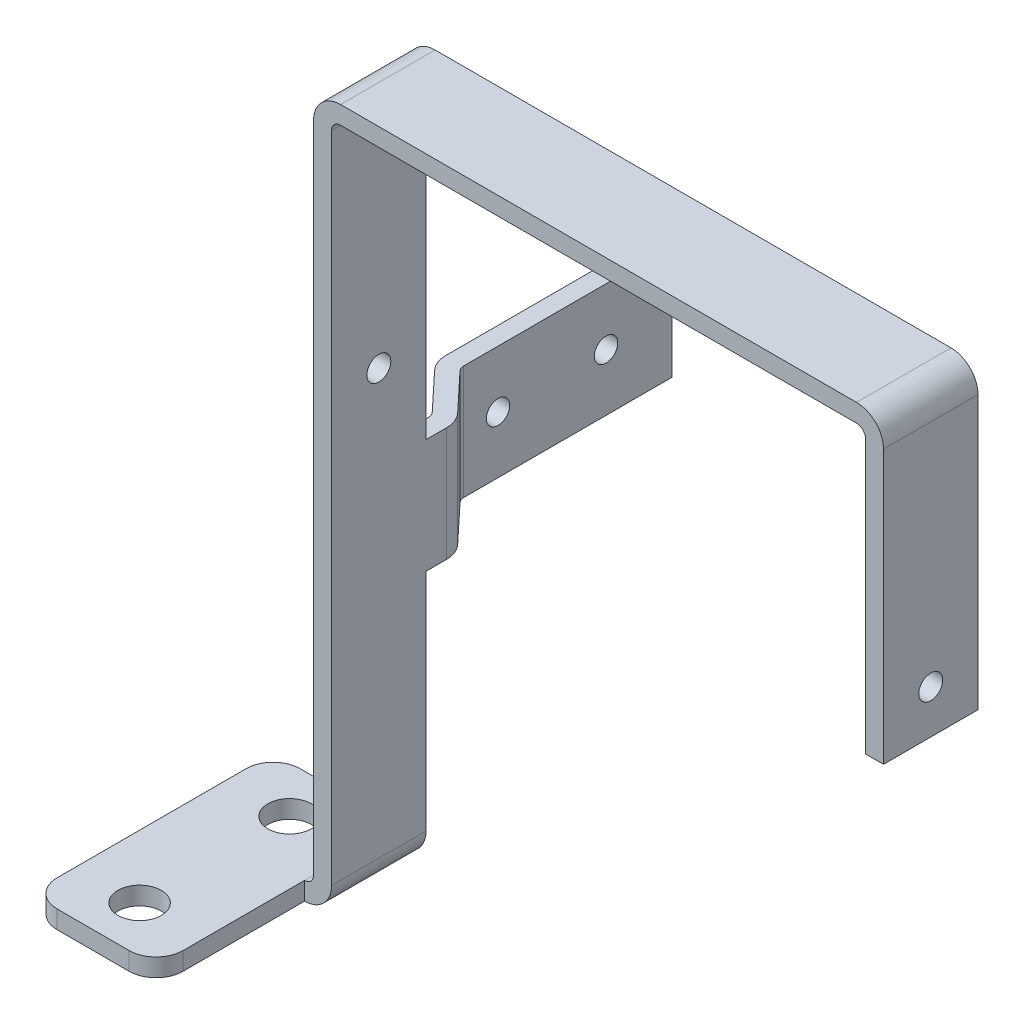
ISO-10303-21;
HEADER;
FILE_DESCRIPTION(('STEP AP214'),'2;1');
FILE_NAME('part.step','',(''),(''),'','','');
FILE_SCHEMA(('AUTOMOTIVE_DESIGN { 1 0 10303 214 1 1 1 1 }'));
ENDSEC;
DATA;
#1=APPLICATION_CONTEXT('core data for automotive mechanical design processes');
#2=APPLICATION_PROTOCOL_DEFINITION('international standard','automotive_design',2000,#1);
#3=PRODUCT_CONTEXT('',#1,'mechanical');
#4=PRODUCT('Part','Part','',(#3));
#5=PRODUCT_RELATED_PRODUCT_CATEGORY('part','',(#4));
#6=PRODUCT_DEFINITION_FORMATION('','',#4);
#7=PRODUCT_DEFINITION_CONTEXT('part definition',#1,'design');
#8=PRODUCT_DEFINITION('design','',#6,#7);
#9=PRODUCT_DEFINITION_SHAPE('','',#8);
#10=(LENGTH_UNIT() NAMED_UNIT(*) SI_UNIT(.MILLI.,.METRE.));
#11=(NAMED_UNIT(*) PLANE_ANGLE_UNIT() SI_UNIT($,.RADIAN.));
#12=(NAMED_UNIT(*) SI_UNIT($,.STERADIAN.) SOLID_ANGLE_UNIT());
#13=UNCERTAINTY_MEASURE_WITH_UNIT(LENGTH_MEASURE(1.E-05),#10,'distance_accuracy_value','');
#14=(GEOMETRIC_REPRESENTATION_CONTEXT(3) GLOBAL_UNCERTAINTY_ASSIGNED_CONTEXT((#13)) GLOBAL_UNIT_ASSIGNED_CONTEXT((#10,
#11,#12)) REPRESENTATION_CONTEXT('',''));
#15=CARTESIAN_POINT('',(0.,0.,0.));
#16=DIRECTION('',(0.,0.,1.));
#17=DIRECTION('',(1.,0.,0.));
#18=AXIS2_PLACEMENT_3D('',#15,#16,#17);
#19=CARTESIAN_POINT('',(0.,0.,-4.0005));
#20=DIRECTION('',(0.,0.,-1.));
#21=DIRECTION('',(-1.,0.,0.));
#22=AXIS2_PLACEMENT_3D('',#19,#20,#21);
#23=PLANE('',#22);
#24=DIRECTION('',(-1.,0.,0.));
#25=VECTOR('',#24,1.);
#26=CARTESIAN_POINT('',(0.,25.4,-4.0005));
#27=LINE('',#26,#25);
#28=CARTESIAN_POINT('',(21.844,25.4,-4.0005));
#29=VERTEX_POINT('',#28);
#30=CARTESIAN_POINT('',(-21.844,25.4,-4.0005));
#31=VERTEX_POINT('',#30);
#32=EDGE_CURVE('E331',#29,#31,#27,.T.);
#33=ORIENTED_EDGE('',*,*,#32,.F.);
#34=CARTESIAN_POINT('',(21.844,23.114,-4.0005));
#35=DIRECTION('',(0.,0.,-1.));
#36=DIRECTION('',(-1.,0.,0.));
#37=AXIS2_PLACEMENT_3D('',#34,#35,#36);
#38=CIRCLE('',#37,2.286);
#39=CARTESIAN_POINT('',(24.13,23.114,-4.0005));
#40=VERTEX_POINT('',#39);
#41=EDGE_CURVE('E287',#29,#40,#38,.T.);
#42=ORIENTED_EDGE('',*,*,#41,.T.);
#43=DIRECTION('',(0.,1.,0.));
#44=VECTOR('',#43,1.);
#45=CARTESIAN_POINT('',(24.13,25.4,-4.0005));
#46=LINE('',#45,#44);
#47=CARTESIAN_POINT('',(24.13,0.,-4.0005));
#48=VERTEX_POINT('',#47);
#49=EDGE_CURVE('E352',#48,#40,#46,.T.);
#50=ORIENTED_EDGE('',*,*,#49,.F.);
#51=DIRECTION('',(-1.,0.,0.));
#52=VECTOR('',#51,1.);
#53=CARTESIAN_POINT('',(24.13,0.,-4.0005));
#54=LINE('',#53,#52);
#55=CARTESIAN_POINT('',(22.606,0.,-4.0005));
#56=VERTEX_POINT('',#55);
#57=EDGE_CURVE('E364',#48,#56,#54,.T.);
#58=ORIENTED_EDGE('',*,*,#57,.T.);
#59=DIRECTION('',(0.,1.,0.));
#60=VECTOR('',#59,1.);
#61=CARTESIAN_POINT('',(22.606,25.4,-4.0005));
#62=LINE('',#61,#60);
#63=CARTESIAN_POINT('',(22.606,23.114,-4.0005));
#64=VERTEX_POINT('',#63);
#65=EDGE_CURVE('E402',#56,#64,#62,.T.);
#66=ORIENTED_EDGE('',*,*,#65,.T.);
#67=CARTESIAN_POINT('',(21.844,23.114,-4.0005));
#68=DIRECTION('',(0.,0.,-1.));
#69=DIRECTION('',(-1.,0.,0.));
#70=AXIS2_PLACEMENT_3D('',#67,#68,#69);
#71=CIRCLE('',#70,0.762);
#72=CARTESIAN_POINT('',(21.844,23.876,-4.0005));
#73=VERTEX_POINT('',#72);
#74=EDGE_CURVE('E457',#64,#73,#71,.F.);
#75=ORIENTED_EDGE('',*,*,#74,.T.);
#76=DIRECTION('',(-1.,0.,0.));
#77=VECTOR('',#76,1.);
#78=CARTESIAN_POINT('',(-24.13,23.876,-4.0005));
#79=LINE('',#78,#77);
#80=CARTESIAN_POINT('',(-21.844,23.876,-4.0005));
#81=VERTEX_POINT('',#80);
#82=EDGE_CURVE('E434',#73,#81,#79,.T.);
#83=ORIENTED_EDGE('',*,*,#82,.T.);
#84=CARTESIAN_POINT('',(-21.844,23.114,-4.0005));
#85=DIRECTION('',(0.,0.,-1.));
#86=DIRECTION('',(-1.,0.,0.));
#87=AXIS2_PLACEMENT_3D('',#84,#85,#86);
#88=CIRCLE('',#87,0.762);
#89=CARTESIAN_POINT('',(-22.606,23.114,-4.0005));
#90=VERTEX_POINT('',#89);
#91=EDGE_CURVE('E461',#81,#90,#88,.F.);
#92=ORIENTED_EDGE('',*,*,#91,.T.);
#93=DIRECTION('',(0.,-1.,0.));
#94=VECTOR('',#93,1.);
#95=CARTESIAN_POINT('',(-22.606,0.,-4.0005));
#96=LINE('',#95,#94);
#97=CARTESIAN_POINT('',(-22.606,-3.55600000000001,-4.0005));
#98=VERTEX_POINT('',#97);
#99=EDGE_CURVE('E438',#90,#98,#96,.T.);
#100=ORIENTED_EDGE('',*,*,#99,.T.);
#101=DIRECTION('',(-1.,0.,0.));
#102=VECTOR('',#101,1.);
#103=CARTESIAN_POINT('',(-22.606,-3.55600000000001,-4.0005));
#104=LINE('',#103,#102);
#105=CARTESIAN_POINT('',(-24.13,-3.55600000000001,-4.0005));
#106=VERTEX_POINT('',#105);
#107=EDGE_CURVE('E499',#98,#106,#104,.T.);
#108=ORIENTED_EDGE('',*,*,#107,.T.);
#109=DIRECTION('',(0.,-1.,0.));
#110=VECTOR('',#109,1.);
#111=CARTESIAN_POINT('',(-24.13,0.,-4.0005));
#112=LINE('',#111,#110);
#113=CARTESIAN_POINT('',(-24.13,23.114,-4.0005));
#114=VERTEX_POINT('',#113);
#115=EDGE_CURVE('E320',#114,#106,#112,.T.);
#116=ORIENTED_EDGE('',*,*,#115,.F.);
#117=CARTESIAN_POINT('',(-21.844,23.114,-4.0005));
#118=DIRECTION('',(0.,0.,-1.));
#119=DIRECTION('',(-1.,0.,0.));
#120=AXIS2_PLACEMENT_3D('',#117,#118,#119);
#121=CIRCLE('',#120,2.286);
#122=EDGE_CURVE('E346',#114,#31,#121,.T.);
#123=ORIENTED_EDGE('',*,*,#122,.T.);
#124=EDGE_LOOP('',(#33,#42,#50,#58,#66,#75,#83,#92,#100,#108,#116,#123));
#125=FACE_BOUND('',#124,.T.);
#126=ADVANCED_FACE('F32',(#125),#23,.T.);
#127=CARTESIAN_POINT('',(-24.13,-33.02,-4.0005));
#128=DIRECTION('',(0.,1.,0.));
#129=DIRECTION('',(-1.,0.,0.));
#130=AXIS2_PLACEMENT_3D('',#127,#128,#129);
#131=PLANE('',#130);
#132=CARTESIAN_POINT('',(-30.226,-33.02,12.6365));
#133=DIRECTION('',(0.,1.,0.));
#134=DIRECTION('',(1.,0.,0.));
#135=AXIS2_PLACEMENT_3D('',#132,#133,#134);
#136=CIRCLE('',#135,1.8415);
#137=CARTESIAN_POINT('',(-28.3845,-33.02,12.6365));
#138=VERTEX_POINT('',#137);
#139=EDGE_CURVE('E683',#138,#138,#136,.T.);
#140=ORIENTED_EDGE('',*,*,#139,.F.);
#141=EDGE_LOOP('',(#140));
#142=FACE_BOUND('',#141,.T.);
#143=CARTESIAN_POINT('',(-30.226,-33.02,-0.0634999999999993));
#144=DIRECTION('',(0.,1.,0.));
#145=DIRECTION('',(-1.,0.,0.));
#146=AXIS2_PLACEMENT_3D('',#143,#144,#145);
#147=CIRCLE('',#146,1.8415);
#148=CARTESIAN_POINT('',(-32.0675,-33.02,-0.0634999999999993));
#149=VERTEX_POINT('',#148);
#150=EDGE_CURVE('E677',#149,#149,#147,.T.);
#151=ORIENTED_EDGE('',*,*,#150,.F.);
#152=EDGE_LOOP('',(#151));
#153=FACE_BOUND('',#152,.T.);
#154=DIRECTION('',(1.,0.,0.));
#155=VECTOR('',#154,1.);
#156=CARTESIAN_POINT('',(-35.56,-33.02,16.5735));
#157=LINE('',#156,#155);
#158=CARTESIAN_POINT('',(-33.274,-33.02,16.5735));
#159=VERTEX_POINT('',#158);
#160=CARTESIAN_POINT('',(-27.178,-33.02,16.5735));
#161=VERTEX_POINT('',#160);
#162=EDGE_CURVE('E674',#159,#161,#157,.T.);
#163=ORIENTED_EDGE('',*,*,#162,.T.);
#164=CARTESIAN_POINT('',(-27.178,-33.02,14.2875));
#165=DIRECTION('',(0.,1.,0.));
#166=DIRECTION('',(-1.,0.,0.));
#167=AXIS2_PLACEMENT_3D('',#164,#165,#166);
#168=CIRCLE('',#167,2.286);
#169=CARTESIAN_POINT('',(-24.892,-33.02,14.2875));
#170=VERTEX_POINT('',#169);
#171=EDGE_CURVE('E299',#161,#170,#168,.T.);
#172=ORIENTED_EDGE('',*,*,#171,.T.);
#173=DIRECTION('',(0.,0.,-1.));
#174=VECTOR('',#173,1.);
#175=CARTESIAN_POINT('',(-24.892,-33.02,-4.0005));
#176=LINE('',#175,#174);
#177=CARTESIAN_POINT('',(-24.892,-33.02,4.0005));
#178=VERTEX_POINT('',#177);
#179=EDGE_CURVE('E255',#170,#178,#176,.T.);
#180=ORIENTED_EDGE('',*,*,#179,.T.);
#181=DIRECTION('',(0.,0.,1.));
#182=VECTOR('',#181,1.);
#183=CARTESIAN_POINT('',(-24.892,-33.02,-4.0005));
#184=LINE('',#183,#182);
#185=CARTESIAN_POINT('',(-24.892,-33.02,-4.0005));
#186=VERTEX_POINT('',#185);
#187=EDGE_CURVE('E445',#178,#186,#184,.F.);
#188=ORIENTED_EDGE('',*,*,#187,.T.);
#189=DIRECTION('',(-1.,0.,0.));
#190=VECTOR('',#189,1.);
#191=CARTESIAN_POINT('',(-24.13,-33.02,-4.0005));
#192=LINE('',#191,#190);
#193=CARTESIAN_POINT('',(-33.274,-33.02,-4.0005));
#194=VERTEX_POINT('',#193);
#195=EDGE_CURVE('E385',#186,#194,#192,.T.);
#196=ORIENTED_EDGE('',*,*,#195,.T.);
#197=CARTESIAN_POINT('',(-33.274,-33.02,-1.7145));
#198=DIRECTION('',(0.,1.,0.));
#199=DIRECTION('',(-1.,0.,0.));
#200=AXIS2_PLACEMENT_3D('',#197,#198,#199);
#201=CIRCLE('',#200,2.286);
#202=CARTESIAN_POINT('',(-35.56,-33.02,-1.7145));
#203=VERTEX_POINT('',#202);
#204=EDGE_CURVE('E295',#194,#203,#201,.T.);
#205=ORIENTED_EDGE('',*,*,#204,.T.);
#206=DIRECTION('',(0.,0.,1.));
#207=VECTOR('',#206,1.);
#208=CARTESIAN_POINT('',(-35.56,-33.02,-4.0005));
#209=LINE('',#208,#207);
#210=CARTESIAN_POINT('',(-35.56,-33.02,14.2875));
#211=VERTEX_POINT('',#210);
#212=EDGE_CURVE('E312',#203,#211,#209,.T.);
#213=ORIENTED_EDGE('',*,*,#212,.T.);
#214=CARTESIAN_POINT('',(-33.274,-33.02,14.2875));
#215=DIRECTION('',(0.,1.,0.));
#216=DIRECTION('',(-1.,0.,0.));
#217=AXIS2_PLACEMENT_3D('',#214,#215,#216);
#218=CIRCLE('',#217,2.286);
#219=EDGE_CURVE('E297',#211,#159,#218,.T.);
#220=ORIENTED_EDGE('',*,*,#219,.T.);
#221=EDGE_LOOP('',(#163,#172,#180,#188,#196,#205,#213,#220));
#222=FACE_BOUND('',#221,.T.);
#223=ADVANCED_FACE('F317',(#142,#153,#222),#131,.T.);
#224=CARTESIAN_POINT('',(-24.13,0.,-4.0005));
#225=DIRECTION('',(-1.,0.,0.));
#226=DIRECTION('',(0.,-1.,0.));
#227=AXIS2_PLACEMENT_3D('',#224,#225,#226);
#228=PLANE('',#227);
#229=CARTESIAN_POINT('',(-24.13,3.683,0.));
#230=DIRECTION('',(-1.,0.,0.));
#231=DIRECTION('',(0.,-1.,0.));
#232=AXIS2_PLACEMENT_3D('',#229,#230,#231);
#233=CIRCLE('',#232,1.016);
#234=CARTESIAN_POINT('',(-24.13,4.699,0.));
#235=VERTEX_POINT('',#234);
#236=EDGE_CURVE('E686',#235,#235,#233,.T.);
#237=ORIENTED_EDGE('',*,*,#236,.F.);
#238=EDGE_LOOP('',(#237));
#239=FACE_BOUND('',#238,.T.);
#240=DIRECTION('',(0.,-1.,0.));
#241=VECTOR('',#240,1.);
#242=CARTESIAN_POINT('',(-24.13,0.,4.0005));
#243=LINE('',#242,#241);
#244=CARTESIAN_POINT('',(-24.13,23.114,4.0005));
#245=VERTEX_POINT('',#244);
#246=CARTESIAN_POINT('',(-24.13,-32.258,4.0005));
#247=VERTEX_POINT('',#246);
#248=EDGE_CURVE('E382',#245,#247,#243,.T.);
#249=ORIENTED_EDGE('',*,*,#248,.F.);
#250=DIRECTION('',(0.,0.,1.));
#251=VECTOR('',#250,1.);
#252=CARTESIAN_POINT('',(-24.13,23.114,-4.0005));
#253=LINE('',#252,#251);
#254=EDGE_CURVE('E283',#245,#114,#253,.F.);
#255=ORIENTED_EDGE('',*,*,#254,.T.);
#256=ORIENTED_EDGE('',*,*,#115,.T.);
#257=DIRECTION('',(0.,0.,-1.));
#258=VECTOR('',#257,1.);
#259=CARTESIAN_POINT('',(-24.13,-3.55600000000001,-4.0005));
#260=LINE('',#259,#258);
#261=CARTESIAN_POINT('',(-24.13,-3.55600000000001,-5.73116902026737));
#262=VERTEX_POINT('',#261);
#263=EDGE_CURVE('E502',#106,#262,#260,.T.);
#264=ORIENTED_EDGE('',*,*,#263,.T.);
#265=DIRECTION('',(0.,1.,0.));
#266=VECTOR('',#265,1.);
#267=CARTESIAN_POINT('',(-24.13,0.,-5.73116902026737));
#268=LINE('',#267,#266);
#269=CARTESIAN_POINT('',(-24.13,-13.208,-5.73116902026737));
#270=VERTEX_POINT('',#269);
#271=EDGE_CURVE('E523',#262,#270,#268,.F.);
#272=ORIENTED_EDGE('',*,*,#271,.T.);
#273=DIRECTION('',(0.,0.,-1.));
#274=VECTOR('',#273,1.);
#275=CARTESIAN_POINT('',(-24.13,-13.208,-4.0005));
#276=LINE('',#275,#274);
#277=CARTESIAN_POINT('',(-24.13,-13.208,-4.0005));
#278=VERTEX_POINT('',#277);
#279=EDGE_CURVE('E615',#278,#270,#276,.T.);
#280=ORIENTED_EDGE('',*,*,#279,.F.);
#281=CARTESIAN_POINT('',(-24.13,-32.258,-4.0005));
#282=VERTEX_POINT('',#281);
#283=EDGE_CURVE('E324',#278,#282,#112,.T.);
#284=ORIENTED_EDGE('',*,*,#283,.T.);
#285=DIRECTION('',(0.,0.,1.));
#286=VECTOR('',#285,1.);
#287=CARTESIAN_POINT('',(-24.13,-32.258,4.0005));
#288=LINE('',#287,#286);
#289=EDGE_CURVE('E520',#282,#247,#288,.T.);
#290=ORIENTED_EDGE('',*,*,#289,.T.);
#291=EDGE_LOOP('',(#249,#255,#256,#264,#272,#280,#284,#290));
#292=FACE_BOUND('',#291,.T.);
#293=ADVANCED_FACE('F553',(#239,#292),#228,.T.);
#294=CARTESIAN_POINT('',(-24.13,25.4,-4.0005));
#295=DIRECTION('',(0.,1.,0.));
#296=DIRECTION('',(-1.,0.,0.));
#297=AXIS2_PLACEMENT_3D('',#294,#295,#296);
#298=PLANE('',#297);
#299=DIRECTION('',(-1.,0.,0.));
#300=VECTOR('',#299,1.);
#301=CARTESIAN_POINT('',(-24.13,25.4,4.0005));
#302=LINE('',#301,#300);
#303=CARTESIAN_POINT('',(21.844,25.4,4.0005));
#304=VERTEX_POINT('',#303);
#305=CARTESIAN_POINT('',(-21.844,25.4,4.0005));
#306=VERTEX_POINT('',#305);
#307=EDGE_CURVE('E381',#304,#306,#302,.T.);
#308=ORIENTED_EDGE('',*,*,#307,.F.);
#309=DIRECTION('',(0.,0.,1.));
#310=VECTOR('',#309,1.);
#311=CARTESIAN_POINT('',(21.844,25.4,-4.0005));
#312=LINE('',#311,#310);
#313=EDGE_CURVE('E344',#304,#29,#312,.F.);
#314=ORIENTED_EDGE('',*,*,#313,.T.);
#315=ORIENTED_EDGE('',*,*,#32,.T.);
#316=DIRECTION('',(0.,0.,1.));
#317=VECTOR('',#316,1.);
#318=CARTESIAN_POINT('',(-21.844,25.4,-4.0005));
#319=LINE('',#318,#317);
#320=EDGE_CURVE('E374',#31,#306,#319,.T.);
#321=ORIENTED_EDGE('',*,*,#320,.T.);
#322=EDGE_LOOP('',(#308,#314,#315,#321));
#323=FACE_BOUND('',#322,.T.);
#324=ADVANCED_FACE('F380',(#323),#298,.T.);
#325=CARTESIAN_POINT('',(24.13,25.4,-4.0005));
#326=DIRECTION('',(1.,0.,0.));
#327=DIRECTION('',(0.,1.,0.));
#328=AXIS2_PLACEMENT_3D('',#325,#326,#327);
#329=PLANE('',#328);
#330=CARTESIAN_POINT('',(24.13,3.683,0.));
#331=DIRECTION('',(1.,0.,0.));
#332=DIRECTION('',(0.,1.,0.));
#333=AXIS2_PLACEMENT_3D('',#330,#331,#332);
#334=CIRCLE('',#333,1.016);
#335=CARTESIAN_POINT('',(24.13,4.699,0.));
#336=VERTEX_POINT('',#335);
#337=EDGE_CURVE('E694',#336,#336,#334,.T.);
#338=ORIENTED_EDGE('',*,*,#337,.F.);
#339=EDGE_LOOP('',(#338));
#340=FACE_BOUND('',#339,.T.);
#341=ORIENTED_EDGE('',*,*,#49,.T.);
#342=DIRECTION('',(0.,0.,1.));
#343=VECTOR('',#342,1.);
#344=CARTESIAN_POINT('',(24.13,23.114,-4.0005));
#345=LINE('',#344,#343);
#346=CARTESIAN_POINT('',(24.13,23.114,4.0005));
#347=VERTEX_POINT('',#346);
#348=EDGE_CURVE('E276',#40,#347,#345,.T.);
#349=ORIENTED_EDGE('',*,*,#348,.T.);
#350=DIRECTION('',(0.,1.,0.));
#351=VECTOR('',#350,1.);
#352=CARTESIAN_POINT('',(24.13,25.4,4.0005));
#353=LINE('',#352,#351);
#354=CARTESIAN_POINT('',(24.13,0.,4.0005));
#355=VERTEX_POINT('',#354);
#356=EDGE_CURVE('E383',#355,#347,#353,.T.);
#357=ORIENTED_EDGE('',*,*,#356,.F.);
#358=DIRECTION('',(0.,0.,1.));
#359=VECTOR('',#358,1.);
#360=CARTESIAN_POINT('',(24.13,0.,-4.0005));
#361=LINE('',#360,#359);
#362=EDGE_CURVE('E362',#48,#355,#361,.T.);
#363=ORIENTED_EDGE('',*,*,#362,.F.);
#364=EDGE_LOOP('',(#341,#349,#357,#363));
#365=FACE_BOUND('',#364,.T.);
#366=ADVANCED_FACE('F359',(#340,#365),#329,.T.);
#367=CARTESIAN_POINT('',(24.13,0.,-4.0005));
#368=DIRECTION('',(0.,1.,0.));
#369=DIRECTION('',(0.,0.,1.));
#370=AXIS2_PLACEMENT_3D('',#367,#368,#369);
#371=PLANE('',#370);
#372=DIRECTION('',(-1.,0.,0.));
#373=VECTOR('',#372,1.);
#374=CARTESIAN_POINT('',(24.13,0.,4.0005));
#375=LINE('',#374,#373);
#376=CARTESIAN_POINT('',(22.606,0.,4.0005));
#377=VERTEX_POINT('',#376);
#378=EDGE_CURVE('E387',#355,#377,#375,.T.);
#379=ORIENTED_EDGE('',*,*,#378,.T.);
#380=DIRECTION('',(0.,0.,1.));
#381=VECTOR('',#380,1.);
#382=CARTESIAN_POINT('',(22.606,0.,-4.0005));
#383=LINE('',#382,#381);
#384=EDGE_CURVE('E322',#56,#377,#383,.T.);
#385=ORIENTED_EDGE('',*,*,#384,.F.);
#386=ORIENTED_EDGE('',*,*,#57,.F.);
#387=ORIENTED_EDGE('',*,*,#362,.T.);
#388=EDGE_LOOP('',(#379,#385,#386,#387));
#389=FACE_BOUND('',#388,.T.);
#390=ADVANCED_FACE('F778',(#389),#371,.F.);
#391=CARTESIAN_POINT('',(22.606,25.4,-4.0005));
#392=DIRECTION('',(1.,0.,0.));
#393=DIRECTION('',(0.,1.,0.));
#394=AXIS2_PLACEMENT_3D('',#391,#392,#393);
#395=PLANE('',#394);
#396=CARTESIAN_POINT('',(22.606,3.683,0.));
#397=DIRECTION('',(1.,0.,0.));
#398=DIRECTION('',(0.,1.,0.));
#399=AXIS2_PLACEMENT_3D('',#396,#397,#398);
#400=CIRCLE('',#399,1.016);
#401=CARTESIAN_POINT('',(22.606,4.699,0.));
#402=VERTEX_POINT('',#401);
#403=EDGE_CURVE('E691',#402,#402,#400,.T.);
#404=ORIENTED_EDGE('',*,*,#403,.T.);
#405=EDGE_LOOP('',(#404));
#406=FACE_BOUND('',#405,.T.);
#407=DIRECTION('',(0.,1.,0.));
#408=VECTOR('',#407,1.);
#409=CARTESIAN_POINT('',(22.606,25.4,4.0005));
#410=LINE('',#409,#408);
#411=CARTESIAN_POINT('',(22.606,23.114,4.0005));
#412=VERTEX_POINT('',#411);
#413=EDGE_CURVE('E399',#377,#412,#410,.T.);
#414=ORIENTED_EDGE('',*,*,#413,.T.);
#415=DIRECTION('',(0.,0.,1.));
#416=VECTOR('',#415,1.);
#417=CARTESIAN_POINT('',(22.606,23.114,-4.0005));
#418=LINE('',#417,#416);
#419=EDGE_CURVE('E441',#412,#64,#418,.F.);
#420=ORIENTED_EDGE('',*,*,#419,.T.);
#421=ORIENTED_EDGE('',*,*,#65,.F.);
#422=ORIENTED_EDGE('',*,*,#384,.T.);
#423=EDGE_LOOP('',(#414,#420,#421,#422));
#424=FACE_BOUND('',#423,.T.);
#425=ADVANCED_FACE('F398',(#406,#424),#395,.F.);
#426=CARTESIAN_POINT('',(0.,23.876,-4.0005));
#427=DIRECTION('',(0.,1.,0.));
#428=DIRECTION('',(-1.,0.,0.));
#429=AXIS2_PLACEMENT_3D('',#426,#427,#428);
#430=PLANE('',#429);
#431=ORIENTED_EDGE('',*,*,#82,.F.);
#432=DIRECTION('',(0.,0.,1.));
#433=VECTOR('',#432,1.);
#434=CARTESIAN_POINT('',(21.844,23.876,4.0005));
#435=LINE('',#434,#433);
#436=CARTESIAN_POINT('',(21.844,23.876,4.0005));
#437=VERTEX_POINT('',#436);
#438=EDGE_CURVE('E526',#73,#437,#435,.T.);
#439=ORIENTED_EDGE('',*,*,#438,.T.);
#440=DIRECTION('',(-1.,0.,0.));
#441=VECTOR('',#440,1.);
#442=CARTESIAN_POINT('',(0.,23.876,4.0005));
#443=LINE('',#442,#441);
#444=CARTESIAN_POINT('',(-21.844,23.876,4.0005));
#445=VERTEX_POINT('',#444);
#446=EDGE_CURVE('E407',#437,#445,#443,.T.);
#447=ORIENTED_EDGE('',*,*,#446,.T.);
#448=DIRECTION('',(0.,0.,1.));
#449=VECTOR('',#448,1.);
#450=CARTESIAN_POINT('',(-21.844,23.876,-4.0005));
#451=LINE('',#450,#449);
#452=EDGE_CURVE('E525',#445,#81,#451,.F.);
#453=ORIENTED_EDGE('',*,*,#452,.T.);
#454=EDGE_LOOP('',(#431,#439,#447,#453));
#455=FACE_BOUND('',#454,.T.);
#456=ADVANCED_FACE('F703',(#455),#430,.F.);
#457=CARTESIAN_POINT('',(-22.606,0.,-4.0005));
#458=DIRECTION('',(-1.,0.,0.));
#459=DIRECTION('',(0.,0.,1.));
#460=AXIS2_PLACEMENT_3D('',#457,#458,#459);
#461=PLANE('',#460);
#462=CARTESIAN_POINT('',(-22.606,3.683,0.));
#463=DIRECTION('',(-1.,0.,0.));
#464=DIRECTION('',(0.,0.,1.));
#465=AXIS2_PLACEMENT_3D('',#462,#463,#464);
#466=CIRCLE('',#465,1.016);
#467=CARTESIAN_POINT('',(-22.606,4.699,0.));
#468=VERTEX_POINT('',#467);
#469=EDGE_CURVE('E36',#468,#468,#466,.T.);
#470=ORIENTED_EDGE('',*,*,#469,.T.);
#471=EDGE_LOOP('',(#470));
#472=FACE_BOUND('',#471,.T.);
#473=DIRECTION('',(0.,0.,-1.));
#474=VECTOR('',#473,1.);
#475=CARTESIAN_POINT('',(-22.606,-13.208,-4.0005));
#476=LINE('',#475,#474);
#477=CARTESIAN_POINT('',(-22.606,-13.208,-4.0005));
#478=VERTEX_POINT('',#477);
#479=CARTESIAN_POINT('',(-22.606,-13.208,-5.73116902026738));
#480=VERTEX_POINT('',#479);
#481=EDGE_CURVE('E489',#478,#480,#476,.T.);
#482=ORIENTED_EDGE('',*,*,#481,.T.);
#483=DIRECTION('',(0.,1.,0.));
#484=VECTOR('',#483,1.);
#485=CARTESIAN_POINT('',(-22.606,-3.55600000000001,-5.73116902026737));
#486=LINE('',#485,#484);
#487=CARTESIAN_POINT('',(-22.606,-3.55600000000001,-5.73116902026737));
#488=VERTEX_POINT('',#487);
#489=EDGE_CURVE('E369',#480,#488,#486,.T.);
#490=ORIENTED_EDGE('',*,*,#489,.T.);
#491=DIRECTION('',(0.,0.,-1.));
#492=VECTOR('',#491,1.);
#493=CARTESIAN_POINT('',(-22.606,-3.55600000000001,-4.0005));
#494=LINE('',#493,#492);
#495=EDGE_CURVE('E486',#98,#488,#494,.T.);
#496=ORIENTED_EDGE('',*,*,#495,.F.);
#497=ORIENTED_EDGE('',*,*,#99,.F.);
#498=DIRECTION('',(0.,0.,1.));
#499=VECTOR('',#498,1.);
#500=CARTESIAN_POINT('',(-22.606,23.114,4.0005));
#501=LINE('',#500,#499);
#502=CARTESIAN_POINT('',(-22.606,23.114,4.0005));
#503=VERTEX_POINT('',#502);
#504=EDGE_CURVE('E443',#90,#503,#501,.T.);
#505=ORIENTED_EDGE('',*,*,#504,.T.);
#506=DIRECTION('',(0.,1.,0.));
#507=VECTOR('',#506,1.);
#508=CARTESIAN_POINT('',(-22.606,0.,4.0005));
#509=LINE('',#508,#507);
#510=CARTESIAN_POINT('',(-22.606,-32.258,4.0005));
#511=VERTEX_POINT('',#510);
#512=EDGE_CURVE('E339',#503,#511,#509,.F.);
#513=ORIENTED_EDGE('',*,*,#512,.T.);
#514=DIRECTION('',(0.,0.,1.));
#515=VECTOR('',#514,1.);
#516=CARTESIAN_POINT('',(-22.606,-32.258,-4.0005));
#517=LINE('',#516,#515);
#518=CARTESIAN_POINT('',(-22.606,-32.258,-4.0005));
#519=VERTEX_POINT('',#518);
#520=EDGE_CURVE('E274',#511,#519,#517,.F.);
#521=ORIENTED_EDGE('',*,*,#520,.T.);
#522=EDGE_CURVE('E332',#478,#519,#96,.T.);
#523=ORIENTED_EDGE('',*,*,#522,.F.);
#524=EDGE_LOOP('',(#482,#490,#496,#497,#505,#513,#521,#523));
#525=FACE_BOUND('',#524,.T.);
#526=ADVANCED_FACE('F484',(#472,#525),#461,.F.);
#527=CARTESIAN_POINT('',(-24.13,-34.544,-4.0005));
#528=DIRECTION('',(0.,1.,0.));
#529=DIRECTION('',(-1.,0.,0.));
#530=AXIS2_PLACEMENT_3D('',#527,#528,#529);
#531=PLANE('',#530);
#532=CARTESIAN_POINT('',(-30.226,-34.544,12.6365));
#533=DIRECTION('',(0.,1.,0.));
#534=DIRECTION('',(1.,0.,0.));
#535=AXIS2_PLACEMENT_3D('',#532,#533,#534);
#536=CIRCLE('',#535,1.8415);
#537=CARTESIAN_POINT('',(-28.3845,-34.544,12.6365));
#538=VERTEX_POINT('',#537);
#539=EDGE_CURVE('E680',#538,#538,#536,.T.);
#540=ORIENTED_EDGE('',*,*,#539,.T.);
#541=EDGE_LOOP('',(#540));
#542=FACE_BOUND('',#541,.T.);
#543=CARTESIAN_POINT('',(-30.226,-34.544,-0.0634999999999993));
#544=DIRECTION('',(0.,1.,0.));
#545=DIRECTION('',(-1.,0.,0.));
#546=AXIS2_PLACEMENT_3D('',#543,#544,#545);
#547=CIRCLE('',#546,1.8415);
#548=CARTESIAN_POINT('',(-32.0675,-34.544,-0.0634999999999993));
#549=VERTEX_POINT('',#548);
#550=EDGE_CURVE('E675',#549,#549,#547,.T.);
#551=ORIENTED_EDGE('',*,*,#550,.T.);
#552=EDGE_LOOP('',(#551));
#553=FACE_BOUND('',#552,.T.);
#554=DIRECTION('',(0.,0.,1.));
#555=VECTOR('',#554,1.);
#556=CARTESIAN_POINT('',(-24.892,-34.544,-4.0005));
#557=LINE('',#556,#555);
#558=CARTESIAN_POINT('',(-24.892,-34.544,4.0005));
#559=VERTEX_POINT('',#558);
#560=CARTESIAN_POINT('',(-24.892,-34.544,14.2875));
#561=VERTEX_POINT('',#560);
#562=EDGE_CURVE('E244',#559,#561,#557,.T.);
#563=ORIENTED_EDGE('',*,*,#562,.T.);
#564=CARTESIAN_POINT('',(-27.178,-34.544,14.2875));
#565=DIRECTION('',(0.,1.,0.));
#566=DIRECTION('',(-1.,0.,0.));
#567=AXIS2_PLACEMENT_3D('',#564,#565,#566);
#568=CIRCLE('',#567,2.286);
#569=CARTESIAN_POINT('',(-27.178,-34.544,16.5735));
#570=VERTEX_POINT('',#569);
#571=EDGE_CURVE('E305',#561,#570,#568,.F.);
#572=ORIENTED_EDGE('',*,*,#571,.T.);
#573=DIRECTION('',(-1.,0.,0.));
#574=VECTOR('',#573,1.);
#575=CARTESIAN_POINT('',(-35.56,-34.544,16.5735));
#576=LINE('',#575,#574);
#577=CARTESIAN_POINT('',(-33.274,-34.544,16.5735));
#578=VERTEX_POINT('',#577);
#579=EDGE_CURVE('E254',#570,#578,#576,.T.);
#580=ORIENTED_EDGE('',*,*,#579,.T.);
#581=CARTESIAN_POINT('',(-33.274,-34.544,14.2875));
#582=DIRECTION('',(0.,1.,0.));
#583=DIRECTION('',(-1.,0.,0.));
#584=AXIS2_PLACEMENT_3D('',#581,#582,#583);
#585=CIRCLE('',#584,2.286);
#586=CARTESIAN_POINT('',(-35.56,-34.544,14.2875));
#587=VERTEX_POINT('',#586);
#588=EDGE_CURVE('E48',#578,#587,#585,.F.);
#589=ORIENTED_EDGE('',*,*,#588,.T.);
#590=DIRECTION('',(0.,0.,1.));
#591=VECTOR('',#590,1.);
#592=CARTESIAN_POINT('',(-35.56,-34.544,-4.0005));
#593=LINE('',#592,#591);
#594=CARTESIAN_POINT('',(-35.56,-34.544,-1.7145));
#595=VERTEX_POINT('',#594);
#596=EDGE_CURVE('E313',#595,#587,#593,.T.);
#597=ORIENTED_EDGE('',*,*,#596,.F.);
#598=CARTESIAN_POINT('',(-33.274,-34.544,-1.7145));
#599=DIRECTION('',(0.,1.,0.));
#600=DIRECTION('',(-1.,0.,0.));
#601=AXIS2_PLACEMENT_3D('',#598,#599,#600);
#602=CIRCLE('',#601,2.286);
#603=CARTESIAN_POINT('',(-33.274,-34.544,-4.0005));
#604=VERTEX_POINT('',#603);
#605=EDGE_CURVE('E302',#595,#604,#602,.F.);
#606=ORIENTED_EDGE('',*,*,#605,.T.);
#607=DIRECTION('',(-1.,0.,0.));
#608=VECTOR('',#607,1.);
#609=CARTESIAN_POINT('',(-24.13,-34.544,-4.0005));
#610=LINE('',#609,#608);
#611=CARTESIAN_POINT('',(-24.892,-34.544,-4.0005));
#612=VERTEX_POINT('',#611);
#613=EDGE_CURVE('E281',#612,#604,#610,.T.);
#614=ORIENTED_EDGE('',*,*,#613,.F.);
#615=DIRECTION('',(0.,0.,1.));
#616=VECTOR('',#615,1.);
#617=CARTESIAN_POINT('',(-24.892,-34.544,-4.0005));
#618=LINE('',#617,#616);
#619=EDGE_CURVE('E273',#612,#559,#618,.T.);
#620=ORIENTED_EDGE('',*,*,#619,.T.);
#621=EDGE_LOOP('',(#563,#572,#580,#589,#597,#606,#614,#620));
#622=FACE_BOUND('',#621,.T.);
#623=ADVANCED_FACE('F279',(#542,#553,#622),#531,.F.);
#624=CARTESIAN_POINT('',(-35.56,-34.544,-4.0005));
#625=DIRECTION('',(1.,0.,0.));
#626=DIRECTION('',(0.,0.,-1.));
#627=AXIS2_PLACEMENT_3D('',#624,#625,#626);
#628=PLANE('',#627);
#629=ORIENTED_EDGE('',*,*,#596,.T.);
#630=DIRECTION('',(0.,1.,0.));
#631=VECTOR('',#630,1.);
#632=CARTESIAN_POINT('',(-35.56,-33.02,14.2875));
#633=LINE('',#632,#631);
#634=EDGE_CURVE('E41',#587,#211,#633,.T.);
#635=ORIENTED_EDGE('',*,*,#634,.T.);
#636=ORIENTED_EDGE('',*,*,#212,.F.);
#637=DIRECTION('',(0.,1.,0.));
#638=VECTOR('',#637,1.);
#639=CARTESIAN_POINT('',(-35.56,-34.544,-1.7145));
#640=LINE('',#639,#638);
#641=EDGE_CURVE('E55',#203,#595,#640,.F.);
#642=ORIENTED_EDGE('',*,*,#641,.T.);
#643=EDGE_LOOP('',(#629,#635,#636,#642));
#644=FACE_BOUND('',#643,.T.);
#645=ADVANCED_FACE('F311',(#644),#628,.F.);
#646=ORIENTED_EDGE('',*,*,#613,.T.);
#647=DIRECTION('',(0.,1.,0.));
#648=VECTOR('',#647,1.);
#649=CARTESIAN_POINT('',(-33.274,-33.02,-4.0005));
#650=LINE('',#649,#648);
#651=EDGE_CURVE('E11',#604,#194,#650,.T.);
#652=ORIENTED_EDGE('',*,*,#651,.T.);
#653=ORIENTED_EDGE('',*,*,#195,.F.);
#654=CARTESIAN_POINT('',(-24.892,-32.258,-4.0005));
#655=DIRECTION('',(0.,0.,-1.));
#656=DIRECTION('',(-1.,0.,0.));
#657=AXIS2_PLACEMENT_3D('',#654,#655,#656);
#658=CIRCLE('',#657,0.762);
#659=EDGE_CURVE('E464',#186,#282,#658,.F.);
#660=ORIENTED_EDGE('',*,*,#659,.T.);
#661=ORIENTED_EDGE('',*,*,#283,.F.);
#662=DIRECTION('',(-1.,0.,0.));
#663=VECTOR('',#662,1.);
#664=CARTESIAN_POINT('',(-22.606,-13.208,-4.0005));
#665=LINE('',#664,#663);
#666=EDGE_CURVE('E619',#478,#278,#665,.T.);
#667=ORIENTED_EDGE('',*,*,#666,.F.);
#668=ORIENTED_EDGE('',*,*,#522,.T.);
#669=CARTESIAN_POINT('',(-24.892,-32.258,-4.0005));
#670=DIRECTION('',(0.,0.,-1.));
#671=DIRECTION('',(-1.,0.,0.));
#672=AXIS2_PLACEMENT_3D('',#669,#670,#671);
#673=CIRCLE('',#672,2.286);
#674=EDGE_CURVE('E282',#519,#612,#673,.T.);
#675=ORIENTED_EDGE('',*,*,#674,.T.);
#676=EDGE_LOOP('',(#646,#652,#653,#660,#661,#667,#668,#675));
#677=FACE_BOUND('',#676,.T.);
#678=ADVANCED_FACE('F549',(#677),#23,.T.);
#679=CARTESIAN_POINT('',(0.,0.,4.0005));
#680=DIRECTION('',(0.,0.,-1.));
#681=DIRECTION('',(-1.,0.,0.));
#682=AXIS2_PLACEMENT_3D('',#679,#680,#681);
#683=PLANE('',#682);
#684=CARTESIAN_POINT('',(-24.892,-32.258,4.0005));
#685=DIRECTION('',(0.,0.,-1.));
#686=DIRECTION('',(-1.,0.,0.));
#687=AXIS2_PLACEMENT_3D('',#684,#685,#686);
#688=CIRCLE('',#687,0.762);
#689=EDGE_CURVE('E264',#247,#178,#688,.T.);
#690=ORIENTED_EDGE('',*,*,#689,.T.);
#691=DIRECTION('',(0.,-1.,0.));
#692=VECTOR('',#691,1.);
#693=CARTESIAN_POINT('',(-24.892,0.,4.0005));
#694=LINE('',#693,#692);
#695=EDGE_CURVE('E248',#178,#559,#694,.T.);
#696=ORIENTED_EDGE('',*,*,#695,.T.);
#697=CARTESIAN_POINT('',(-24.892,-32.258,4.0005));
#698=DIRECTION('',(0.,0.,-1.));
#699=DIRECTION('',(-1.,0.,0.));
#700=AXIS2_PLACEMENT_3D('',#697,#698,#699);
#701=CIRCLE('',#700,2.286);
#702=EDGE_CURVE('E261',#559,#511,#701,.F.);
#703=ORIENTED_EDGE('',*,*,#702,.T.);
#704=ORIENTED_EDGE('',*,*,#512,.F.);
#705=CARTESIAN_POINT('',(-21.844,23.114,4.0005));
#706=DIRECTION('',(0.,0.,-1.));
#707=DIRECTION('',(-1.,0.,0.));
#708=AXIS2_PLACEMENT_3D('',#705,#706,#707);
#709=CIRCLE('',#708,0.762);
#710=EDGE_CURVE('E459',#503,#445,#709,.T.);
#711=ORIENTED_EDGE('',*,*,#710,.T.);
#712=ORIENTED_EDGE('',*,*,#446,.F.);
#713=CARTESIAN_POINT('',(21.844,23.114,4.0005));
#714=DIRECTION('',(0.,0.,-1.));
#715=DIRECTION('',(-1.,0.,0.));
#716=AXIS2_PLACEMENT_3D('',#713,#714,#715);
#717=CIRCLE('',#716,0.762);
#718=EDGE_CURVE('E406',#437,#412,#717,.T.);
#719=ORIENTED_EDGE('',*,*,#718,.T.);
#720=ORIENTED_EDGE('',*,*,#413,.F.);
#721=ORIENTED_EDGE('',*,*,#378,.F.);
#722=ORIENTED_EDGE('',*,*,#356,.T.);
#723=CARTESIAN_POINT('',(21.844,23.114,4.0005));
#724=DIRECTION('',(0.,0.,-1.));
#725=DIRECTION('',(-1.,0.,0.));
#726=AXIS2_PLACEMENT_3D('',#723,#724,#725);
#727=CIRCLE('',#726,2.286);
#728=EDGE_CURVE('E366',#347,#304,#727,.F.);
#729=ORIENTED_EDGE('',*,*,#728,.T.);
#730=ORIENTED_EDGE('',*,*,#307,.T.);
#731=CARTESIAN_POINT('',(-21.844,23.114,4.0005));
#732=DIRECTION('',(0.,0.,-1.));
#733=DIRECTION('',(-1.,0.,0.));
#734=AXIS2_PLACEMENT_3D('',#731,#732,#733);
#735=CIRCLE('',#734,2.286);
#736=EDGE_CURVE('E275',#306,#245,#735,.F.);
#737=ORIENTED_EDGE('',*,*,#736,.T.);
#738=ORIENTED_EDGE('',*,*,#248,.T.);
#739=EDGE_LOOP('',(#690,#696,#703,#704,#711,#712,#719,#720,#721,#722,#729,#730,#737,#738));
#740=FACE_BOUND('',#739,.T.);
#741=ADVANCED_FACE('F259',(#740),#683,.F.);
#742=CARTESIAN_POINT('',(-26.416,-13.208,-10.0965));
#743=DIRECTION('',(1.,0.,0.));
#744=DIRECTION('',(0.,1.,0.));
#745=AXIS2_PLACEMENT_3D('',#742,#743,#744);
#746=PLANE('',#745);
#747=CARTESIAN_POINT('',(-26.416,-8.38200000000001,-13.9065));
#748=DIRECTION('',(1.,0.,0.));
#749=DIRECTION('',(0.,1.,0.));
#750=AXIS2_PLACEMENT_3D('',#747,#748,#749);
#751=CIRCLE('',#750,0.990599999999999);
#752=CARTESIAN_POINT('',(-26.416,-9.37260000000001,-13.9065));
#753=VERTEX_POINT('',#752);
#754=EDGE_CURVE('E667',#753,#753,#751,.T.);
#755=ORIENTED_EDGE('',*,*,#754,.F.);
#756=EDGE_LOOP('',(#755));
#757=FACE_BOUND('',#756,.T.);
#758=CARTESIAN_POINT('',(-26.416,-8.38200000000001,-23.0505));
#759=DIRECTION('',(1.,0.,0.));
#760=DIRECTION('',(0.,1.,0.));
#761=AXIS2_PLACEMENT_3D('',#758,#759,#760);
#762=CIRCLE('',#761,0.990600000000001);
#763=CARTESIAN_POINT('',(-26.416,-9.37260000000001,-23.0505));
#764=VERTEX_POINT('',#763);
#765=EDGE_CURVE('E638',#764,#764,#762,.T.);
#766=ORIENTED_EDGE('',*,*,#765,.F.);
#767=EDGE_LOOP('',(#766));
#768=FACE_BOUND('',#767,.T.);
#769=DIRECTION('',(0.,0.,-1.));
#770=VECTOR('',#769,1.);
#771=CARTESIAN_POINT('',(-26.416,-3.55600000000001,-10.0965));
#772=LINE('',#771,#770);
#773=CARTESIAN_POINT('',(-26.416,-3.55600000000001,-11.0004929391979));
#774=VERTEX_POINT('',#773);
#775=CARTESIAN_POINT('',(-26.416,-3.55600000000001,-28.6385));
#776=VERTEX_POINT('',#775);
#777=EDGE_CURVE('E635',#774,#776,#772,.T.);
#778=ORIENTED_EDGE('',*,*,#777,.F.);
#779=DIRECTION('',(0.,1.,0.));
#780=VECTOR('',#779,1.);
#781=CARTESIAN_POINT('',(-26.416,-13.208,-11.0004929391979));
#782=LINE('',#781,#780);
#783=CARTESIAN_POINT('',(-26.416,-13.208,-11.0004929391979));
#784=VERTEX_POINT('',#783);
#785=EDGE_CURVE('E515',#774,#784,#782,.F.);
#786=ORIENTED_EDGE('',*,*,#785,.T.);
#787=DIRECTION('',(0.,0.,-1.));
#788=VECTOR('',#787,1.);
#789=CARTESIAN_POINT('',(-26.416,-13.208,-10.0965));
#790=LINE('',#789,#788);
#791=CARTESIAN_POINT('',(-26.416,-13.208,-28.6385));
#792=VERTEX_POINT('',#791);
#793=EDGE_CURVE('E501',#784,#792,#790,.T.);
#794=ORIENTED_EDGE('',*,*,#793,.T.);
#795=DIRECTION('',(0.,1.,0.));
#796=VECTOR('',#795,1.);
#797=CARTESIAN_POINT('',(-26.416,-13.208,-28.6385));
#798=LINE('',#797,#796);
#799=EDGE_CURVE('E417',#792,#776,#798,.T.);
#800=ORIENTED_EDGE('',*,*,#799,.T.);
#801=EDGE_LOOP('',(#778,#786,#794,#800));
#802=FACE_BOUND('',#801,.T.);
#803=ADVANCED_FACE('F564',(#757,#768,#802),#746,.T.);
#804=CARTESIAN_POINT('',(-23.0181853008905,-13.208,-7.07482628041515));
#805=DIRECTION('',(0.729537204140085,0.,-0.68394112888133));
#806=DIRECTION('',(-0.68394112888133,0.,-0.729537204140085));
#807=AXIS2_PLACEMENT_3D('',#804,#805,#806);
#808=PLANE('',#807);
#809=DIRECTION('',(-0.68394112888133,0.,-0.729537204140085));
#810=VECTOR('',#809,1.);
#811=CARTESIAN_POINT('',(-23.0181853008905,-3.55600000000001,-7.07482628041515));
#812=LINE('',#811,#810);
#813=CARTESIAN_POINT('',(-23.2242779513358,-3.55600000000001,-7.29465844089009));
#814=VERTEX_POINT('',#813);
#815=CARTESIAN_POINT('',(-26.2099073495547,-3.55600000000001,-10.4793297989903));
#816=VERTEX_POINT('',#815);
#817=EDGE_CURVE('E428',#814,#816,#812,.T.);
#818=ORIENTED_EDGE('',*,*,#817,.F.);
#819=DIRECTION('',(0.,1.,0.));
#820=VECTOR('',#819,1.);
#821=CARTESIAN_POINT('',(-23.2242779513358,-13.208,-7.2946584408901));
#822=LINE('',#821,#820);
#823=CARTESIAN_POINT('',(-23.2242779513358,-13.208,-7.2946584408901));
#824=VERTEX_POINT('',#823);
#825=EDGE_CURVE('E367',#814,#824,#822,.F.);
#826=ORIENTED_EDGE('',*,*,#825,.T.);
#827=DIRECTION('',(-0.68394112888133,0.,-0.729537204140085));
#828=VECTOR('',#827,1.);
#829=CARTESIAN_POINT('',(-23.0181853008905,-13.208,-7.07482628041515));
#830=LINE('',#829,#828);
#831=CARTESIAN_POINT('',(-26.2099073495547,-13.208,-10.4793297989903));
#832=VERTEX_POINT('',#831);
#833=EDGE_CURVE('E425',#824,#832,#830,.T.);
#834=ORIENTED_EDGE('',*,*,#833,.T.);
#835=DIRECTION('',(0.,1.,0.));
#836=VECTOR('',#835,1.);
#837=CARTESIAN_POINT('',(-26.2099073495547,-3.55600000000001,-10.4793297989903));
#838=LINE('',#837,#836);
#839=EDGE_CURVE('E391',#832,#816,#838,.T.);
#840=ORIENTED_EDGE('',*,*,#839,.T.);
#841=EDGE_LOOP('',(#818,#826,#834,#840));
#842=FACE_BOUND('',#841,.T.);
#843=ADVANCED_FACE('F731',(#842),#808,.T.);
#844=CARTESIAN_POINT('',(-24.13,-13.208,-6.0325));
#845=DIRECTION('',(0.729537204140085,0.,-0.68394112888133));
#846=DIRECTION('',(-0.68394112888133,0.,-0.729537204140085));
#847=AXIS2_PLACEMENT_3D('',#844,#845,#846);
#848=PLANE('',#847);
#849=DIRECTION('',(-0.68394112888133,0.,-0.729537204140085));
#850=VECTOR('',#849,1.);
#851=CARTESIAN_POINT('',(-24.13,-3.55600000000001,-6.0325));
#852=LINE('',#851,#850);
#853=CARTESIAN_POINT('',(-24.3360926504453,-3.55600000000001,-6.25233216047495));
#854=VERTEX_POINT('',#853);
#855=CARTESIAN_POINT('',(-27.3217220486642,-3.55600000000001,-9.43700351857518));
#856=VERTEX_POINT('',#855);
#857=EDGE_CURVE('E510',#854,#856,#852,.T.);
#858=ORIENTED_EDGE('',*,*,#857,.T.);
#859=DIRECTION('',(0.,1.,0.));
#860=VECTOR('',#859,1.);
#861=CARTESIAN_POINT('',(-27.3217220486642,-13.208,-9.43700351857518));
#862=LINE('',#861,#860);
#863=CARTESIAN_POINT('',(-27.3217220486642,-13.208,-9.43700351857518));
#864=VERTEX_POINT('',#863);
#865=EDGE_CURVE('E473',#856,#864,#862,.F.);
#866=ORIENTED_EDGE('',*,*,#865,.T.);
#867=DIRECTION('',(-0.68394112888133,0.,-0.729537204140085));
#868=VECTOR('',#867,1.);
#869=CARTESIAN_POINT('',(-24.13,-13.208,-6.0325));
#870=LINE('',#869,#868);
#871=CARTESIAN_POINT('',(-24.3360926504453,-13.208,-6.25233216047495));
#872=VERTEX_POINT('',#871);
#873=EDGE_CURVE('E620',#872,#864,#870,.T.);
#874=ORIENTED_EDGE('',*,*,#873,.F.);
#875=DIRECTION('',(0.,1.,0.));
#876=VECTOR('',#875,1.);
#877=CARTESIAN_POINT('',(-24.3360926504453,-13.208,-6.25233216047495));
#878=LINE('',#877,#876);
#879=EDGE_CURVE('E517',#872,#854,#878,.T.);
#880=ORIENTED_EDGE('',*,*,#879,.T.);
#881=EDGE_LOOP('',(#858,#866,#874,#880));
#882=FACE_BOUND('',#881,.T.);
#883=ADVANCED_FACE('F647',(#882),#848,.F.);
#884=CARTESIAN_POINT('',(-27.94,-13.208,-10.0965));
#885=DIRECTION('',(1.,0.,0.));
#886=DIRECTION('',(0.,1.,0.));
#887=AXIS2_PLACEMENT_3D('',#884,#885,#886);
#888=PLANE('',#887);
#889=CARTESIAN_POINT('',(-27.94,-8.38200000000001,-13.9065));
#890=DIRECTION('',(-1.,0.,0.));
#891=DIRECTION('',(0.,-1.,0.));
#892=AXIS2_PLACEMENT_3D('',#889,#890,#891);
#893=CIRCLE('',#892,0.990599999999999);
#894=CARTESIAN_POINT('',(-27.94,-9.37260000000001,-13.9065));
#895=VERTEX_POINT('',#894);
#896=EDGE_CURVE('E266',#895,#895,#893,.T.);
#897=ORIENTED_EDGE('',*,*,#896,.F.);
#898=EDGE_LOOP('',(#897));
#899=FACE_BOUND('',#898,.T.);
#900=CARTESIAN_POINT('',(-27.94,-8.38200000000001,-23.0505));
#901=DIRECTION('',(-1.,0.,0.));
#902=DIRECTION('',(0.,-1.,0.));
#903=AXIS2_PLACEMENT_3D('',#900,#901,#902);
#904=CIRCLE('',#903,0.990600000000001);
#905=CARTESIAN_POINT('',(-27.94,-9.37260000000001,-23.0505));
#906=VERTEX_POINT('',#905);
#907=EDGE_CURVE('E664',#906,#906,#904,.T.);
#908=ORIENTED_EDGE('',*,*,#907,.F.);
#909=EDGE_LOOP('',(#908));
#910=FACE_BOUND('',#909,.T.);
#911=DIRECTION('',(0.,0.,-1.));
#912=VECTOR('',#911,1.);
#913=CARTESIAN_POINT('',(-27.94,-13.208,-10.0965));
#914=LINE('',#913,#912);
#915=CARTESIAN_POINT('',(-27.94,-13.208,-11.0004929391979));
#916=VERTEX_POINT('',#915);
#917=CARTESIAN_POINT('',(-27.94,-13.208,-28.6385));
#918=VERTEX_POINT('',#917);
#919=EDGE_CURVE('E623',#916,#918,#914,.T.);
#920=ORIENTED_EDGE('',*,*,#919,.F.);
#921=DIRECTION('',(0.,1.,0.));
#922=VECTOR('',#921,1.);
#923=CARTESIAN_POINT('',(-27.94,-13.208,-11.0004929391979));
#924=LINE('',#923,#922);
#925=CARTESIAN_POINT('',(-27.94,-3.55600000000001,-11.0004929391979));
#926=VERTEX_POINT('',#925);
#927=EDGE_CURVE('E466',#916,#926,#924,.T.);
#928=ORIENTED_EDGE('',*,*,#927,.T.);
#929=DIRECTION('',(0.,0.,-1.));
#930=VECTOR('',#929,1.);
#931=CARTESIAN_POINT('',(-27.94,-3.55600000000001,-10.0965));
#932=LINE('',#931,#930);
#933=CARTESIAN_POINT('',(-27.94,-3.55600000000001,-28.6385));
#934=VERTEX_POINT('',#933);
#935=EDGE_CURVE('E640',#926,#934,#932,.T.);
#936=ORIENTED_EDGE('',*,*,#935,.T.);
#937=DIRECTION('',(0.,1.,0.));
#938=VECTOR('',#937,1.);
#939=CARTESIAN_POINT('',(-27.94,-13.208,-28.6385));
#940=LINE('',#939,#938);
#941=EDGE_CURVE('E413',#918,#934,#940,.T.);
#942=ORIENTED_EDGE('',*,*,#941,.F.);
#943=EDGE_LOOP('',(#920,#928,#936,#942));
#944=FACE_BOUND('',#943,.T.);
#945=ADVANCED_FACE('F656',(#899,#910,#944),#888,.F.);
#946=CARTESIAN_POINT('',(-27.94,-13.208,-28.6385));
#947=DIRECTION('',(0.,0.,1.));
#948=DIRECTION('',(1.,0.,0.));
#949=AXIS2_PLACEMENT_3D('',#946,#947,#948);
#950=PLANE('',#949);
#951=DIRECTION('',(1.,0.,0.));
#952=VECTOR('',#951,1.);
#953=CARTESIAN_POINT('',(-27.94,-3.55600000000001,-28.6385));
#954=LINE('',#953,#952);
#955=EDGE_CURVE('E637',#934,#776,#954,.T.);
#956=ORIENTED_EDGE('',*,*,#955,.T.);
#957=ORIENTED_EDGE('',*,*,#799,.F.);
#958=DIRECTION('',(1.,0.,0.));
#959=VECTOR('',#958,1.);
#960=CARTESIAN_POINT('',(-27.94,-13.208,-28.6385));
#961=LINE('',#960,#959);
#962=EDGE_CURVE('E657',#918,#792,#961,.T.);
#963=ORIENTED_EDGE('',*,*,#962,.F.);
#964=ORIENTED_EDGE('',*,*,#941,.T.);
#965=EDGE_LOOP('',(#956,#957,#963,#964));
#966=FACE_BOUND('',#965,.T.);
#967=ADVANCED_FACE('F746',(#966),#950,.F.);
#968=CARTESIAN_POINT('',(0.,-13.208,0.));
#969=DIRECTION('',(0.,-1.,0.));
#970=DIRECTION('',(-1.,0.,0.));
#971=AXIS2_PLACEMENT_3D('',#968,#969,#970);
#972=PLANE('',#971);
#973=ORIENTED_EDGE('',*,*,#873,.T.);
#974=CARTESIAN_POINT('',(-25.654,-13.208,-11.0004929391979));
#975=DIRECTION('',(0.,-1.,0.));
#976=DIRECTION('',(1.,0.,0.));
#977=AXIS2_PLACEMENT_3D('',#974,#975,#976);
#978=CIRCLE('',#977,2.286);
#979=EDGE_CURVE('E477',#864,#916,#978,.T.);
#980=ORIENTED_EDGE('',*,*,#979,.T.);
#981=ORIENTED_EDGE('',*,*,#919,.T.);
#982=ORIENTED_EDGE('',*,*,#962,.T.);
#983=ORIENTED_EDGE('',*,*,#793,.F.);
#984=CARTESIAN_POINT('',(-25.654,-13.208,-11.0004929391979));
#985=DIRECTION('',(0.,-1.,0.));
#986=DIRECTION('',(1.,0.,0.));
#987=AXIS2_PLACEMENT_3D('',#984,#985,#986);
#988=CIRCLE('',#987,0.762);
#989=EDGE_CURVE('E449',#784,#832,#988,.F.);
#990=ORIENTED_EDGE('',*,*,#989,.T.);
#991=ORIENTED_EDGE('',*,*,#833,.F.);
#992=CARTESIAN_POINT('',(-24.892,-13.208,-5.73116902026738));
#993=DIRECTION('',(0.,-1.,0.));
#994=DIRECTION('',(1.,0.,0.));
#995=AXIS2_PLACEMENT_3D('',#992,#993,#994);
#996=CIRCLE('',#995,2.286);
#997=EDGE_CURVE('E475',#824,#480,#996,.T.);
#998=ORIENTED_EDGE('',*,*,#997,.T.);
#999=ORIENTED_EDGE('',*,*,#481,.F.);
#1000=ORIENTED_EDGE('',*,*,#666,.T.);
#1001=ORIENTED_EDGE('',*,*,#279,.T.);
#1002=CARTESIAN_POINT('',(-24.892,-13.208,-5.73116902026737));
#1003=DIRECTION('',(0.,-1.,0.));
#1004=DIRECTION('',(1.,0.,0.));
#1005=AXIS2_PLACEMENT_3D('',#1002,#1003,#1004);
#1006=CIRCLE('',#1005,0.762);
#1007=EDGE_CURVE('E454',#270,#872,#1006,.F.);
#1008=ORIENTED_EDGE('',*,*,#1007,.T.);
#1009=EDGE_LOOP('',(#973,#980,#981,#982,#983,#990,#991,#998,#999,#1000,#1001,#1008));
#1010=FACE_BOUND('',#1009,.T.);
#1011=ADVANCED_FACE('F653',(#1010),#972,.T.);
#1012=CARTESIAN_POINT('',(0.,-3.556,0.));
#1013=DIRECTION('',(0.,-1.,0.));
#1014=DIRECTION('',(-1.,0.,0.));
#1015=AXIS2_PLACEMENT_3D('',#1012,#1013,#1014);
#1016=PLANE('',#1015);
#1017=ORIENTED_EDGE('',*,*,#935,.F.);
#1018=CARTESIAN_POINT('',(-25.654,-3.55600000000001,-11.0004929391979));
#1019=DIRECTION('',(0.,-1.,0.));
#1020=DIRECTION('',(1.,0.,0.));
#1021=AXIS2_PLACEMENT_3D('',#1018,#1019,#1020);
#1022=CIRCLE('',#1021,2.286);
#1023=EDGE_CURVE('E471',#926,#856,#1022,.F.);
#1024=ORIENTED_EDGE('',*,*,#1023,.T.);
#1025=ORIENTED_EDGE('',*,*,#857,.F.);
#1026=CARTESIAN_POINT('',(-24.892,-3.55600000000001,-5.73116902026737));
#1027=DIRECTION('',(0.,-1.,0.));
#1028=DIRECTION('',(1.,0.,0.));
#1029=AXIS2_PLACEMENT_3D('',#1026,#1027,#1028);
#1030=CIRCLE('',#1029,0.762);
#1031=EDGE_CURVE('E452',#854,#262,#1030,.T.);
#1032=ORIENTED_EDGE('',*,*,#1031,.T.);
#1033=ORIENTED_EDGE('',*,*,#263,.F.);
#1034=ORIENTED_EDGE('',*,*,#107,.F.);
#1035=ORIENTED_EDGE('',*,*,#495,.T.);
#1036=CARTESIAN_POINT('',(-24.892,-3.55600000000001,-5.73116902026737));
#1037=DIRECTION('',(0.,-1.,0.));
#1038=DIRECTION('',(1.,0.,0.));
#1039=AXIS2_PLACEMENT_3D('',#1036,#1037,#1038);
#1040=CIRCLE('',#1039,2.286);
#1041=EDGE_CURVE('E469',#488,#814,#1040,.F.);
#1042=ORIENTED_EDGE('',*,*,#1041,.T.);
#1043=ORIENTED_EDGE('',*,*,#817,.T.);
#1044=CARTESIAN_POINT('',(-25.654,-3.55600000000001,-11.0004929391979));
#1045=DIRECTION('',(0.,-1.,0.));
#1046=DIRECTION('',(1.,0.,0.));
#1047=AXIS2_PLACEMENT_3D('',#1044,#1045,#1046);
#1048=CIRCLE('',#1047,0.762);
#1049=EDGE_CURVE('E447',#816,#774,#1048,.T.);
#1050=ORIENTED_EDGE('',*,*,#1049,.T.);
#1051=ORIENTED_EDGE('',*,*,#777,.T.);
#1052=ORIENTED_EDGE('',*,*,#955,.F.);
#1053=EDGE_LOOP('',(#1017,#1024,#1025,#1032,#1033,#1034,#1035,#1042,#1043,#1050,#1051,#1052));
#1054=FACE_BOUND('',#1053,.T.);
#1055=ADVANCED_FACE('F495',(#1054),#1016,.F.);
#1056=CARTESIAN_POINT('',(24.13,-8.382,-23.0505));
#1057=DIRECTION('',(-1.,0.,0.));
#1058=DIRECTION('',(0.,-1.,0.));
#1059=AXIS2_PLACEMENT_3D('',#1056,#1057,#1058);
#1060=CYLINDRICAL_SURFACE('',#1059,0.990600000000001);
#1061=CARTESIAN_POINT('',(-26.416,-9.37260000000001,-23.0505));
#1062=CARTESIAN_POINT('',(-26.431875,-9.37260000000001,-23.0505));
#1063=CARTESIAN_POINT('',(-26.44775,-9.37260000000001,-23.0505));
#1064=CARTESIAN_POINT('',(-26.4795,-9.37260000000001,-23.0505));
#1065=CARTESIAN_POINT('',(-26.495375,-9.37260000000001,-23.0505));
#1066=CARTESIAN_POINT('',(-26.527125,-9.37260000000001,-23.0505));
#1067=CARTESIAN_POINT('',(-26.543,-9.37260000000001,-23.0505));
#1068=CARTESIAN_POINT('',(-26.57475,-9.37260000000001,-23.0505));
#1069=CARTESIAN_POINT('',(-26.590625,-9.37260000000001,-23.0505));
#1070=CARTESIAN_POINT('',(-26.622375,-9.37260000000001,-23.0505));
#1071=CARTESIAN_POINT('',(-26.63825,-9.37260000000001,-23.0505));
#1072=CARTESIAN_POINT('',(-26.67,-9.37260000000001,-23.0505));
#1073=CARTESIAN_POINT('',(-26.685875,-9.37260000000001,-23.0505));
#1074=CARTESIAN_POINT('',(-26.717625,-9.37260000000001,-23.0505));
#1075=CARTESIAN_POINT('',(-26.7335,-9.37260000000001,-23.0505));
#1076=CARTESIAN_POINT('',(-26.76525,-9.37260000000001,-23.0505));
#1077=CARTESIAN_POINT('',(-26.781125,-9.37260000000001,-23.0505));
#1078=CARTESIAN_POINT('',(-26.812875,-9.37260000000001,-23.0505));
#1079=CARTESIAN_POINT('',(-26.82875,-9.37260000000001,-23.0505));
#1080=CARTESIAN_POINT('',(-26.8605,-9.37260000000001,-23.0505));
#1081=CARTESIAN_POINT('',(-26.876375,-9.37260000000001,-23.0505));
#1082=CARTESIAN_POINT('',(-26.908125,-9.37260000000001,-23.0505));
#1083=CARTESIAN_POINT('',(-26.924,-9.37260000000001,-23.0505));
#1084=CARTESIAN_POINT('',(-26.95575,-9.37260000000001,-23.0505));
#1085=CARTESIAN_POINT('',(-26.971625,-9.37260000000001,-23.0505));
#1086=CARTESIAN_POINT('',(-27.003375,-9.37260000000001,-23.0505));
#1087=CARTESIAN_POINT('',(-27.01925,-9.37260000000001,-23.0505));
#1088=CARTESIAN_POINT('',(-27.051,-9.37260000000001,-23.0505));
#1089=CARTESIAN_POINT('',(-27.066875,-9.37260000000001,-23.0505));
#1090=CARTESIAN_POINT('',(-27.098625,-9.37260000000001,-23.0505));
#1091=CARTESIAN_POINT('',(-27.1145,-9.37260000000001,-23.0505));
#1092=CARTESIAN_POINT('',(-27.14625,-9.37260000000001,-23.0505));
#1093=CARTESIAN_POINT('',(-27.162125,-9.37260000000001,-23.0505));
#1094=CARTESIAN_POINT('',(-27.193875,-9.37260000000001,-23.0505));
#1095=CARTESIAN_POINT('',(-27.20975,-9.37260000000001,-23.0505));
#1096=CARTESIAN_POINT('',(-27.2415,-9.37260000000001,-23.0505));
#1097=CARTESIAN_POINT('',(-27.257375,-9.37260000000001,-23.0505));
#1098=CARTESIAN_POINT('',(-27.289125,-9.37260000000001,-23.0505));
#1099=CARTESIAN_POINT('',(-27.305,-9.37260000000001,-23.0505));
#1100=CARTESIAN_POINT('',(-27.33675,-9.37260000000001,-23.0505));
#1101=CARTESIAN_POINT('',(-27.352625,-9.37260000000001,-23.0505));
#1102=CARTESIAN_POINT('',(-27.384375,-9.37260000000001,-23.0505));
#1103=CARTESIAN_POINT('',(-27.40025,-9.37260000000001,-23.0505));
#1104=CARTESIAN_POINT('',(-27.432,-9.37260000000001,-23.0505));
#1105=CARTESIAN_POINT('',(-27.447875,-9.37260000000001,-23.0505));
#1106=CARTESIAN_POINT('',(-27.479625,-9.37260000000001,-23.0505));
#1107=CARTESIAN_POINT('',(-27.4955,-9.37260000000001,-23.0505));
#1108=CARTESIAN_POINT('',(-27.52725,-9.37260000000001,-23.0505));
#1109=CARTESIAN_POINT('',(-27.543125,-9.37260000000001,-23.0505));
#1110=CARTESIAN_POINT('',(-27.574875,-9.37260000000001,-23.0505));
#1111=CARTESIAN_POINT('',(-27.59075,-9.37260000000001,-23.0505));
#1112=CARTESIAN_POINT('',(-27.6225,-9.37260000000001,-23.0505));
#1113=CARTESIAN_POINT('',(-27.638375,-9.37260000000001,-23.0505));
#1114=CARTESIAN_POINT('',(-27.670125,-9.37260000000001,-23.0505));
#1115=CARTESIAN_POINT('',(-27.686,-9.37260000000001,-23.0505));
#1116=CARTESIAN_POINT('',(-27.71775,-9.37260000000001,-23.0505));
#1117=CARTESIAN_POINT('',(-27.733625,-9.37260000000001,-23.0505));
#1118=CARTESIAN_POINT('',(-27.765375,-9.37260000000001,-23.0505));
#1119=CARTESIAN_POINT('',(-27.78125,-9.37260000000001,-23.0505));
#1120=CARTESIAN_POINT('',(-27.813,-9.37260000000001,-23.0505));
#1121=CARTESIAN_POINT('',(-27.828875,-9.37260000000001,-23.0505));
#1122=CARTESIAN_POINT('',(-27.860625,-9.37260000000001,-23.0505));
#1123=CARTESIAN_POINT('',(-27.8765,-9.37260000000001,-23.0505));
#1124=CARTESIAN_POINT('',(-27.90825,-9.37260000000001,-23.0505));
#1125=CARTESIAN_POINT('',(-27.924125,-9.37260000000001,-23.0505));
#1126=CARTESIAN_POINT('',(-27.94,-9.37260000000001,-23.0505));
#1127=B_SPLINE_CURVE_WITH_KNOTS('',3,(#1061,#1062,#1063,#1064,#1065,#1066,#1067,#1068,#1069,
#1070,#1071,#1072,#1073,#1074,#1075,#1076,#1077,#1078,#1079,#1080,#1081,#1082,#1083,#1084,#1085,
#1086,#1087,#1088,#1089,#1090,#1091,#1092,#1093,#1094,#1095,#1096,#1097,#1098,#1099,#1100,#1101,
#1102,#1103,#1104,#1105,#1106,#1107,#1108,#1109,#1110,#1111,#1112,#1113,#1114,#1115,#1116,#1117,
#1118,#1119,#1120,#1121,#1122,#1123,#1124,#1125,#1126),.UNSPECIFIED.,.F.,.F.,(4,2,2,2,2,2,2,2,2,
2,2,2,2,2,2,2,2,2,2,2,2,2,2,2,2,2,2,2,2,2,2,2,4),(0.,0.0476250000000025,0.0952499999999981,
0.142875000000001,0.190500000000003,0.238124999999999,0.285750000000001,0.333375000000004,
0.381000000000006,0.428625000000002,0.476250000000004,0.523875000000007,0.571500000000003,
0.619125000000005,0.666750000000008,0.714375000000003,0.762000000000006,0.809625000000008,
0.857250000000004,0.904875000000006,0.952500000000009,1.000125,1.04775000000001,
1.09537500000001,1.14300000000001,1.19062500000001,1.23825000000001,1.28587500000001,
1.33350000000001,1.38112500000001,1.42875000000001,1.47637500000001,1.52400000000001),.UNSPECIFIED.);
#1128=EDGE_CURVE('BSEAM720',#764,#906,#1127,.T.);
#1129=ORIENTED_EDGE('',*,*,#765,.T.);
#1130=ORIENTED_EDGE('',*,*,#907,.T.);
#1131=ORIENTED_EDGE('',*,*,#1128,.T.);
#1132=ORIENTED_EDGE('',*,*,#1128,.F.);
#1133=EDGE_LOOP('',(#1129,#1131,#1130,#1132));
#1134=FACE_BOUND('',#1133,.T.);
#1135=ADVANCED_FACE('F720',(#1134),#1060,.F.);
#1136=CARTESIAN_POINT('',(24.13,-8.382,-13.9065));
#1137=DIRECTION('',(-1.,0.,0.));
#1138=DIRECTION('',(0.,-1.,0.));
#1139=AXIS2_PLACEMENT_3D('',#1136,#1137,#1138);
#1140=CYLINDRICAL_SURFACE('',#1139,0.990599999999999);
#1141=CARTESIAN_POINT('',(-26.416,-9.37260000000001,-13.9065));
#1142=CARTESIAN_POINT('',(-26.431875,-9.37260000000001,-13.9065));
#1143=CARTESIAN_POINT('',(-26.44775,-9.37260000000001,-13.9065));
#1144=CARTESIAN_POINT('',(-26.4795,-9.37260000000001,-13.9065));
#1145=CARTESIAN_POINT('',(-26.495375,-9.37260000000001,-13.9065));
#1146=CARTESIAN_POINT('',(-26.527125,-9.37260000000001,-13.9065));
#1147=CARTESIAN_POINT('',(-26.543,-9.37260000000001,-13.9065));
#1148=CARTESIAN_POINT('',(-26.57475,-9.37260000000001,-13.9065));
#1149=CARTESIAN_POINT('',(-26.590625,-9.37260000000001,-13.9065));
#1150=CARTESIAN_POINT('',(-26.622375,-9.37260000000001,-13.9065));
#1151=CARTESIAN_POINT('',(-26.63825,-9.37260000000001,-13.9065));
#1152=CARTESIAN_POINT('',(-26.67,-9.37260000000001,-13.9065));
#1153=CARTESIAN_POINT('',(-26.685875,-9.37260000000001,-13.9065));
#1154=CARTESIAN_POINT('',(-26.717625,-9.37260000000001,-13.9065));
#1155=CARTESIAN_POINT('',(-26.7335,-9.37260000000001,-13.9065));
#1156=CARTESIAN_POINT('',(-26.76525,-9.37260000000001,-13.9065));
#1157=CARTESIAN_POINT('',(-26.781125,-9.37260000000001,-13.9065));
#1158=CARTESIAN_POINT('',(-26.812875,-9.37260000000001,-13.9065));
#1159=CARTESIAN_POINT('',(-26.82875,-9.37260000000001,-13.9065));
#1160=CARTESIAN_POINT('',(-26.8605,-9.37260000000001,-13.9065));
#1161=CARTESIAN_POINT('',(-26.876375,-9.37260000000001,-13.9065));
#1162=CARTESIAN_POINT('',(-26.908125,-9.37260000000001,-13.9065));
#1163=CARTESIAN_POINT('',(-26.924,-9.37260000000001,-13.9065));
#1164=CARTESIAN_POINT('',(-26.95575,-9.37260000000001,-13.9065));
#1165=CARTESIAN_POINT('',(-26.971625,-9.37260000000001,-13.9065));
#1166=CARTESIAN_POINT('',(-27.003375,-9.37260000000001,-13.9065));
#1167=CARTESIAN_POINT('',(-27.01925,-9.37260000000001,-13.9065));
#1168=CARTESIAN_POINT('',(-27.051,-9.37260000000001,-13.9065));
#1169=CARTESIAN_POINT('',(-27.066875,-9.37260000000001,-13.9065));
#1170=CARTESIAN_POINT('',(-27.098625,-9.37260000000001,-13.9065));
#1171=CARTESIAN_POINT('',(-27.1145,-9.37260000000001,-13.9065));
#1172=CARTESIAN_POINT('',(-27.14625,-9.37260000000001,-13.9065));
#1173=CARTESIAN_POINT('',(-27.162125,-9.37260000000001,-13.9065));
#1174=CARTESIAN_POINT('',(-27.193875,-9.37260000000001,-13.9065));
#1175=CARTESIAN_POINT('',(-27.20975,-9.37260000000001,-13.9065));
#1176=CARTESIAN_POINT('',(-27.2415,-9.37260000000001,-13.9065));
#1177=CARTESIAN_POINT('',(-27.257375,-9.37260000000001,-13.9065));
#1178=CARTESIAN_POINT('',(-27.289125,-9.37260000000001,-13.9065));
#1179=CARTESIAN_POINT('',(-27.305,-9.37260000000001,-13.9065));
#1180=CARTESIAN_POINT('',(-27.33675,-9.37260000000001,-13.9065));
#1181=CARTESIAN_POINT('',(-27.352625,-9.37260000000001,-13.9065));
#1182=CARTESIAN_POINT('',(-27.384375,-9.37260000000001,-13.9065));
#1183=CARTESIAN_POINT('',(-27.40025,-9.37260000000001,-13.9065));
#1184=CARTESIAN_POINT('',(-27.432,-9.37260000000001,-13.9065));
#1185=CARTESIAN_POINT('',(-27.447875,-9.37260000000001,-13.9065));
#1186=CARTESIAN_POINT('',(-27.479625,-9.37260000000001,-13.9065));
#1187=CARTESIAN_POINT('',(-27.4955,-9.37260000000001,-13.9065));
#1188=CARTESIAN_POINT('',(-27.52725,-9.37260000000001,-13.9065));
#1189=CARTESIAN_POINT('',(-27.543125,-9.37260000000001,-13.9065));
#1190=CARTESIAN_POINT('',(-27.574875,-9.37260000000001,-13.9065));
#1191=CARTESIAN_POINT('',(-27.59075,-9.37260000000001,-13.9065));
#1192=CARTESIAN_POINT('',(-27.6225,-9.37260000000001,-13.9065));
#1193=CARTESIAN_POINT('',(-27.638375,-9.37260000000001,-13.9065));
#1194=CARTESIAN_POINT('',(-27.670125,-9.37260000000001,-13.9065));
#1195=CARTESIAN_POINT('',(-27.686,-9.37260000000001,-13.9065));
#1196=CARTESIAN_POINT('',(-27.71775,-9.37260000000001,-13.9065));
#1197=CARTESIAN_POINT('',(-27.733625,-9.37260000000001,-13.9065));
#1198=CARTESIAN_POINT('',(-27.765375,-9.37260000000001,-13.9065));
#1199=CARTESIAN_POINT('',(-27.78125,-9.37260000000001,-13.9065));
#1200=CARTESIAN_POINT('',(-27.813,-9.37260000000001,-13.9065));
#1201=CARTESIAN_POINT('',(-27.828875,-9.37260000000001,-13.9065));
#1202=CARTESIAN_POINT('',(-27.860625,-9.37260000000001,-13.9065));
#1203=CARTESIAN_POINT('',(-27.8765,-9.37260000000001,-13.9065));
#1204=CARTESIAN_POINT('',(-27.90825,-9.37260000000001,-13.9065));
#1205=CARTESIAN_POINT('',(-27.924125,-9.37260000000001,-13.9065));
#1206=CARTESIAN_POINT('',(-27.94,-9.37260000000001,-13.9065));
#1207=B_SPLINE_CURVE_WITH_KNOTS('',3,(#1141,#1142,#1143,#1144,#1145,#1146,#1147,#1148,#1149,
#1150,#1151,#1152,#1153,#1154,#1155,#1156,#1157,#1158,#1159,#1160,#1161,#1162,#1163,#1164,#1165,
#1166,#1167,#1168,#1169,#1170,#1171,#1172,#1173,#1174,#1175,#1176,#1177,#1178,#1179,#1180,#1181,
#1182,#1183,#1184,#1185,#1186,#1187,#1188,#1189,#1190,#1191,#1192,#1193,#1194,#1195,#1196,#1197,
#1198,#1199,#1200,#1201,#1202,#1203,#1204,#1205,#1206),.UNSPECIFIED.,.F.,.F.,(4,2,2,2,2,2,2,2,2,
2,2,2,2,2,2,2,2,2,2,2,2,2,2,2,2,2,2,2,2,2,2,2,4),(0.,0.0476250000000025,0.0952499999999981,
0.142875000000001,0.190500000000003,0.238124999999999,0.285750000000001,0.333375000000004,
0.381000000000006,0.428625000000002,0.476250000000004,0.523875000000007,0.571500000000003,
0.619125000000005,0.666750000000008,0.714375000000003,0.762000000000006,0.809625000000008,
0.857250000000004,0.904875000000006,0.952500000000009,1.000125,1.04775000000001,
1.09537500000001,1.14300000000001,1.19062500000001,1.23825000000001,1.28587500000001,
1.33350000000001,1.38112500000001,1.42875000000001,1.47637500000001,1.52400000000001),.UNSPECIFIED.);
#1208=EDGE_CURVE('BSEAM715',#753,#895,#1207,.T.);
#1209=ORIENTED_EDGE('',*,*,#754,.T.);
#1210=ORIENTED_EDGE('',*,*,#896,.T.);
#1211=ORIENTED_EDGE('',*,*,#1208,.T.);
#1212=ORIENTED_EDGE('',*,*,#1208,.F.);
#1213=EDGE_LOOP('',(#1209,#1211,#1210,#1212));
#1214=FACE_BOUND('',#1213,.T.);
#1215=ADVANCED_FACE('F715',(#1214),#1140,.F.);
#1216=CARTESIAN_POINT('',(-25.654,-13.208,-11.0004929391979));
#1217=DIRECTION('',(0.,-1.,0.));
#1218=DIRECTION('',(1.,0.,0.));
#1219=AXIS2_PLACEMENT_3D('',#1216,#1217,#1218);
#1220=CYLINDRICAL_SURFACE('',#1219,0.762);
#1221=ORIENTED_EDGE('',*,*,#989,.F.);
#1222=ORIENTED_EDGE('',*,*,#785,.F.);
#1223=ORIENTED_EDGE('',*,*,#1049,.F.);
#1224=ORIENTED_EDGE('',*,*,#839,.F.);
#1225=EDGE_LOOP('',(#1221,#1222,#1223,#1224));
#1226=FACE_BOUND('',#1225,.T.);
#1227=ADVANCED_FACE('F544',(#1226),#1220,.F.);
#1228=CARTESIAN_POINT('',(-24.892,-13.208,-5.73116902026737));
#1229=DIRECTION('',(0.,1.,0.));
#1230=DIRECTION('',(0.,0.,1.));
#1231=AXIS2_PLACEMENT_3D('',#1228,#1229,#1230);
#1232=CYLINDRICAL_SURFACE('',#1231,0.762);
#1233=ORIENTED_EDGE('',*,*,#1007,.F.);
#1234=ORIENTED_EDGE('',*,*,#271,.F.);
#1235=ORIENTED_EDGE('',*,*,#1031,.F.);
#1236=ORIENTED_EDGE('',*,*,#879,.F.);
#1237=EDGE_LOOP('',(#1233,#1234,#1235,#1236));
#1238=FACE_BOUND('',#1237,.T.);
#1239=ADVANCED_FACE('F535',(#1238),#1232,.F.);
#1240=CARTESIAN_POINT('',(21.844,23.114,-4.0005));
#1241=DIRECTION('',(0.,0.,-1.));
#1242=DIRECTION('',(-1.,0.,0.));
#1243=AXIS2_PLACEMENT_3D('',#1240,#1241,#1242);
#1244=CYLINDRICAL_SURFACE('',#1243,0.762);
#1245=ORIENTED_EDGE('',*,*,#74,.F.);
#1246=ORIENTED_EDGE('',*,*,#419,.F.);
#1247=ORIENTED_EDGE('',*,*,#718,.F.);
#1248=ORIENTED_EDGE('',*,*,#438,.F.);
#1249=EDGE_LOOP('',(#1245,#1246,#1247,#1248));
#1250=FACE_BOUND('',#1249,.T.);
#1251=ADVANCED_FACE('F532',(#1250),#1244,.F.);
#1252=CARTESIAN_POINT('',(-21.844,23.114,-4.0005));
#1253=DIRECTION('',(0.,0.,-1.));
#1254=DIRECTION('',(-1.,0.,0.));
#1255=AXIS2_PLACEMENT_3D('',#1252,#1253,#1254);
#1256=CYLINDRICAL_SURFACE('',#1255,0.762);
#1257=ORIENTED_EDGE('',*,*,#91,.F.);
#1258=ORIENTED_EDGE('',*,*,#452,.F.);
#1259=ORIENTED_EDGE('',*,*,#710,.F.);
#1260=ORIENTED_EDGE('',*,*,#504,.F.);
#1261=EDGE_LOOP('',(#1257,#1258,#1259,#1260));
#1262=FACE_BOUND('',#1261,.T.);
#1263=ADVANCED_FACE('F534',(#1262),#1256,.F.);
#1264=CARTESIAN_POINT('',(-24.892,-32.258,-4.0005));
#1265=DIRECTION('',(0.,0.,-1.));
#1266=DIRECTION('',(-1.,0.,0.));
#1267=AXIS2_PLACEMENT_3D('',#1264,#1265,#1266);
#1268=CYLINDRICAL_SURFACE('',#1267,0.762);
#1269=ORIENTED_EDGE('',*,*,#659,.F.);
#1270=ORIENTED_EDGE('',*,*,#187,.F.);
#1271=ORIENTED_EDGE('',*,*,#689,.F.);
#1272=ORIENTED_EDGE('',*,*,#289,.F.);
#1273=EDGE_LOOP('',(#1269,#1270,#1271,#1272));
#1274=FACE_BOUND('',#1273,.T.);
#1275=ADVANCED_FACE('F541',(#1274),#1268,.F.);
#1276=CARTESIAN_POINT('',(-25.654,-13.208,-11.0004929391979));
#1277=DIRECTION('',(0.,1.,0.));
#1278=DIRECTION('',(-1.,0.,0.));
#1279=AXIS2_PLACEMENT_3D('',#1276,#1277,#1278);
#1280=CYLINDRICAL_SURFACE('',#1279,2.286);
#1281=ORIENTED_EDGE('',*,*,#979,.F.);
#1282=ORIENTED_EDGE('',*,*,#865,.F.);
#1283=ORIENTED_EDGE('',*,*,#1023,.F.);
#1284=ORIENTED_EDGE('',*,*,#927,.F.);
#1285=EDGE_LOOP('',(#1281,#1282,#1283,#1284));
#1286=FACE_BOUND('',#1285,.T.);
#1287=ADVANCED_FACE('F600',(#1286),#1280,.T.);
#1288=CARTESIAN_POINT('',(-24.892,0.,-5.73116902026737));
#1289=DIRECTION('',(0.,-1.,0.));
#1290=DIRECTION('',(0.,0.,-1.));
#1291=AXIS2_PLACEMENT_3D('',#1288,#1289,#1290);
#1292=CYLINDRICAL_SURFACE('',#1291,2.286);
#1293=ORIENTED_EDGE('',*,*,#997,.F.);
#1294=ORIENTED_EDGE('',*,*,#825,.F.);
#1295=ORIENTED_EDGE('',*,*,#1041,.F.);
#1296=ORIENTED_EDGE('',*,*,#489,.F.);
#1297=EDGE_LOOP('',(#1293,#1294,#1295,#1296));
#1298=FACE_BOUND('',#1297,.T.);
#1299=ADVANCED_FACE('F597',(#1298),#1292,.T.);
#1300=CARTESIAN_POINT('',(21.844,23.114,-4.0005));
#1301=DIRECTION('',(0.,0.,1.));
#1302=DIRECTION('',(1.,0.,0.));
#1303=AXIS2_PLACEMENT_3D('',#1300,#1301,#1302);
#1304=CYLINDRICAL_SURFACE('',#1303,2.286);
#1305=ORIENTED_EDGE('',*,*,#41,.F.);
#1306=ORIENTED_EDGE('',*,*,#313,.F.);
#1307=ORIENTED_EDGE('',*,*,#728,.F.);
#1308=ORIENTED_EDGE('',*,*,#348,.F.);
#1309=EDGE_LOOP('',(#1305,#1306,#1307,#1308));
#1310=FACE_BOUND('',#1309,.T.);
#1311=ADVANCED_FACE('F365',(#1310),#1304,.T.);
#1312=CARTESIAN_POINT('',(-21.844,23.114,-4.0005));
#1313=DIRECTION('',(0.,0.,1.));
#1314=DIRECTION('',(1.,0.,0.));
#1315=AXIS2_PLACEMENT_3D('',#1312,#1313,#1314);
#1316=CYLINDRICAL_SURFACE('',#1315,2.286);
#1317=ORIENTED_EDGE('',*,*,#122,.F.);
#1318=ORIENTED_EDGE('',*,*,#254,.F.);
#1319=ORIENTED_EDGE('',*,*,#736,.F.);
#1320=ORIENTED_EDGE('',*,*,#320,.F.);
#1321=EDGE_LOOP('',(#1317,#1318,#1319,#1320));
#1322=FACE_BOUND('',#1321,.T.);
#1323=ADVANCED_FACE('F591',(#1322),#1316,.T.);
#1324=CARTESIAN_POINT('',(-24.892,-32.258,-4.0005));
#1325=DIRECTION('',(0.,0.,1.));
#1326=DIRECTION('',(1.,0.,0.));
#1327=AXIS2_PLACEMENT_3D('',#1324,#1325,#1326);
#1328=CYLINDRICAL_SURFACE('',#1327,2.286);
#1329=ORIENTED_EDGE('',*,*,#674,.F.);
#1330=ORIENTED_EDGE('',*,*,#520,.F.);
#1331=ORIENTED_EDGE('',*,*,#702,.F.);
#1332=ORIENTED_EDGE('',*,*,#619,.F.);
#1333=EDGE_LOOP('',(#1329,#1330,#1331,#1332));
#1334=FACE_BOUND('',#1333,.T.);
#1335=ADVANCED_FACE('F272',(#1334),#1328,.T.);
#1336=CARTESIAN_POINT('',(-24.892,-57.7193252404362,-4.0005));
#1337=DIRECTION('',(1.,0.,0.));
#1338=DIRECTION('',(0.,1.,0.));
#1339=AXIS2_PLACEMENT_3D('',#1336,#1337,#1338);
#1340=PLANE('',#1339);
#1341=ORIENTED_EDGE('',*,*,#179,.F.);
#1342=DIRECTION('',(0.,1.,0.));
#1343=VECTOR('',#1342,1.);
#1344=CARTESIAN_POINT('',(-24.892,-57.7193252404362,14.2875));
#1345=LINE('',#1344,#1343);
#1346=EDGE_CURVE('E251',#170,#561,#1345,.F.);
#1347=ORIENTED_EDGE('',*,*,#1346,.T.);
#1348=ORIENTED_EDGE('',*,*,#562,.F.);
#1349=ORIENTED_EDGE('',*,*,#695,.F.);
#1350=EDGE_LOOP('',(#1341,#1347,#1348,#1349));
#1351=FACE_BOUND('',#1350,.T.);
#1352=ADVANCED_FACE('F247',(#1351),#1340,.T.);
#1353=CARTESIAN_POINT('',(-35.56,-57.7193252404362,16.5735));
#1354=DIRECTION('',(0.,0.,1.));
#1355=DIRECTION('',(1.,0.,0.));
#1356=AXIS2_PLACEMENT_3D('',#1353,#1354,#1355);
#1357=PLANE('',#1356);
#1358=ORIENTED_EDGE('',*,*,#579,.F.);
#1359=DIRECTION('',(0.,1.,0.));
#1360=VECTOR('',#1359,1.);
#1361=CARTESIAN_POINT('',(-27.178,-57.7193252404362,16.5735));
#1362=LINE('',#1361,#1360);
#1363=EDGE_CURVE('E292',#570,#161,#1362,.T.);
#1364=ORIENTED_EDGE('',*,*,#1363,.T.);
#1365=ORIENTED_EDGE('',*,*,#162,.F.);
#1366=DIRECTION('',(0.,1.,0.));
#1367=VECTOR('',#1366,1.);
#1368=CARTESIAN_POINT('',(-33.274,-34.544,16.5735));
#1369=LINE('',#1368,#1367);
#1370=EDGE_CURVE('E285',#159,#578,#1369,.F.);
#1371=ORIENTED_EDGE('',*,*,#1370,.T.);
#1372=EDGE_LOOP('',(#1358,#1364,#1365,#1371));
#1373=FACE_BOUND('',#1372,.T.);
#1374=ADVANCED_FACE('F759',(#1373),#1357,.T.);
#1375=CARTESIAN_POINT('',(-30.226,-34.544,-0.0634999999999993));
#1376=DIRECTION('',(0.,1.,0.));
#1377=DIRECTION('',(-1.,0.,0.));
#1378=AXIS2_PLACEMENT_3D('',#1375,#1376,#1377);
#1379=CYLINDRICAL_SURFACE('',#1378,1.8415);
#1380=ORIENTED_EDGE('',*,*,#550,.F.);
#1381=EDGE_LOOP('',(#1380));
#1382=FACE_BOUND('',#1381,.T.);
#1383=ORIENTED_EDGE('',*,*,#150,.T.);
#1384=EDGE_LOOP('',(#1383));
#1385=FACE_BOUND('',#1384,.T.);
#1386=ADVANCED_FACE('F762',(#1382,#1385),#1379,.F.);
#1387=CARTESIAN_POINT('',(-30.226,-34.544,12.6365));
#1388=DIRECTION('',(0.,1.,0.));
#1389=DIRECTION('',(-1.,0.,0.));
#1390=AXIS2_PLACEMENT_3D('',#1387,#1388,#1389);
#1391=CYLINDRICAL_SURFACE('',#1390,1.8415);
#1392=ORIENTED_EDGE('',*,*,#539,.F.);
#1393=EDGE_LOOP('',(#1392));
#1394=FACE_BOUND('',#1393,.T.);
#1395=ORIENTED_EDGE('',*,*,#139,.T.);
#1396=EDGE_LOOP('',(#1395));
#1397=FACE_BOUND('',#1396,.T.);
#1398=ADVANCED_FACE('F585',(#1394,#1397),#1391,.F.);
#1399=CARTESIAN_POINT('',(-27.178,-57.7193252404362,14.2875));
#1400=DIRECTION('',(0.,1.,0.));
#1401=DIRECTION('',(-1.,0.,0.));
#1402=AXIS2_PLACEMENT_3D('',#1399,#1400,#1401);
#1403=CYLINDRICAL_SURFACE('',#1402,2.286);
#1404=ORIENTED_EDGE('',*,*,#571,.F.);
#1405=ORIENTED_EDGE('',*,*,#1346,.F.);
#1406=ORIENTED_EDGE('',*,*,#171,.F.);
#1407=ORIENTED_EDGE('',*,*,#1363,.F.);
#1408=EDGE_LOOP('',(#1404,#1405,#1406,#1407));
#1409=FACE_BOUND('',#1408,.T.);
#1410=ADVANCED_FACE('F581',(#1409),#1403,.T.);
#1411=CARTESIAN_POINT('',(-33.274,-34.544,14.2875));
#1412=DIRECTION('',(0.,-1.,0.));
#1413=DIRECTION('',(0.,0.,-1.));
#1414=AXIS2_PLACEMENT_3D('',#1411,#1412,#1413);
#1415=CYLINDRICAL_SURFACE('',#1414,2.286);
#1416=ORIENTED_EDGE('',*,*,#588,.F.);
#1417=ORIENTED_EDGE('',*,*,#1370,.F.);
#1418=ORIENTED_EDGE('',*,*,#219,.F.);
#1419=ORIENTED_EDGE('',*,*,#634,.F.);
#1420=EDGE_LOOP('',(#1416,#1417,#1418,#1419));
#1421=FACE_BOUND('',#1420,.T.);
#1422=ADVANCED_FACE('F573',(#1421),#1415,.T.);
#1423=CARTESIAN_POINT('',(-33.274,0.,-1.7145));
#1424=DIRECTION('',(0.,-1.,0.));
#1425=DIRECTION('',(0.,0.,-1.));
#1426=AXIS2_PLACEMENT_3D('',#1423,#1424,#1425);
#1427=CYLINDRICAL_SURFACE('',#1426,2.286);
#1428=ORIENTED_EDGE('',*,*,#605,.F.);
#1429=ORIENTED_EDGE('',*,*,#641,.F.);
#1430=ORIENTED_EDGE('',*,*,#204,.F.);
#1431=ORIENTED_EDGE('',*,*,#651,.F.);
#1432=EDGE_LOOP('',(#1428,#1429,#1430,#1431));
#1433=FACE_BOUND('',#1432,.T.);
#1434=ADVANCED_FACE('F34',(#1433),#1427,.T.);
#1435=CARTESIAN_POINT('',(-35.56,3.68299999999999,0.));
#1436=DIRECTION('',(1.,0.,0.));
#1437=DIRECTION('',(0.,1.,0.));
#1438=AXIS2_PLACEMENT_3D('',#1435,#1436,#1437);
#1439=CYLINDRICAL_SURFACE('',#1438,1.016);
#1440=CARTESIAN_POINT('',(-24.13,4.699,0.));
#1441=CARTESIAN_POINT('',(-24.114125,4.699,0.));
#1442=CARTESIAN_POINT('',(-24.09825,4.699,0.));
#1443=CARTESIAN_POINT('',(-24.0665,4.699,0.));
#1444=CARTESIAN_POINT('',(-24.050625,4.699,0.));
#1445=CARTESIAN_POINT('',(-24.018875,4.699,0.));
#1446=CARTESIAN_POINT('',(-24.003,4.699,0.));
#1447=CARTESIAN_POINT('',(-23.97125,4.699,0.));
#1448=CARTESIAN_POINT('',(-23.955375,4.699,0.));
#1449=CARTESIAN_POINT('',(-23.923625,4.699,0.));
#1450=CARTESIAN_POINT('',(-23.90775,4.699,0.));
#1451=CARTESIAN_POINT('',(-23.876,4.699,0.));
#1452=CARTESIAN_POINT('',(-23.860125,4.699,0.));
#1453=CARTESIAN_POINT('',(-23.828375,4.699,0.));
#1454=CARTESIAN_POINT('',(-23.8125,4.699,0.));
#1455=CARTESIAN_POINT('',(-23.78075,4.699,0.));
#1456=CARTESIAN_POINT('',(-23.764875,4.699,0.));
#1457=CARTESIAN_POINT('',(-23.733125,4.699,0.));
#1458=CARTESIAN_POINT('',(-23.71725,4.699,0.));
#1459=CARTESIAN_POINT('',(-23.6855,4.699,0.));
#1460=CARTESIAN_POINT('',(-23.669625,4.699,0.));
#1461=CARTESIAN_POINT('',(-23.637875,4.699,0.));
#1462=CARTESIAN_POINT('',(-23.622,4.699,0.));
#1463=CARTESIAN_POINT('',(-23.59025,4.699,0.));
#1464=CARTESIAN_POINT('',(-23.574375,4.699,0.));
#1465=CARTESIAN_POINT('',(-23.542625,4.699,0.));
#1466=CARTESIAN_POINT('',(-23.52675,4.699,0.));
#1467=CARTESIAN_POINT('',(-23.495,4.699,0.));
#1468=CARTESIAN_POINT('',(-23.479125,4.699,0.));
#1469=CARTESIAN_POINT('',(-23.447375,4.699,0.));
#1470=CARTESIAN_POINT('',(-23.4315,4.699,0.));
#1471=CARTESIAN_POINT('',(-23.39975,4.699,0.));
#1472=CARTESIAN_POINT('',(-23.383875,4.699,0.));
#1473=CARTESIAN_POINT('',(-23.352125,4.699,0.));
#1474=CARTESIAN_POINT('',(-23.33625,4.699,0.));
#1475=CARTESIAN_POINT('',(-23.3045,4.699,0.));
#1476=CARTESIAN_POINT('',(-23.288625,4.699,0.));
#1477=CARTESIAN_POINT('',(-23.256875,4.699,0.));
#1478=CARTESIAN_POINT('',(-23.241,4.699,0.));
#1479=CARTESIAN_POINT('',(-23.20925,4.699,0.));
#1480=CARTESIAN_POINT('',(-23.193375,4.699,0.));
#1481=CARTESIAN_POINT('',(-23.161625,4.699,0.));
#1482=CARTESIAN_POINT('',(-23.14575,4.699,0.));
#1483=CARTESIAN_POINT('',(-23.114,4.699,0.));
#1484=CARTESIAN_POINT('',(-23.098125,4.699,0.));
#1485=CARTESIAN_POINT('',(-23.066375,4.699,0.));
#1486=CARTESIAN_POINT('',(-23.0505,4.699,0.));
#1487=CARTESIAN_POINT('',(-23.01875,4.699,0.));
#1488=CARTESIAN_POINT('',(-23.002875,4.699,0.));
#1489=CARTESIAN_POINT('',(-22.971125,4.699,0.));
#1490=CARTESIAN_POINT('',(-22.95525,4.699,0.));
#1491=CARTESIAN_POINT('',(-22.9235,4.699,0.));
#1492=CARTESIAN_POINT('',(-22.907625,4.699,0.));
#1493=CARTESIAN_POINT('',(-22.875875,4.699,0.));
#1494=CARTESIAN_POINT('',(-22.86,4.699,0.));
#1495=CARTESIAN_POINT('',(-22.82825,4.699,0.));
#1496=CARTESIAN_POINT('',(-22.812375,4.699,0.));
#1497=CARTESIAN_POINT('',(-22.780625,4.699,0.));
#1498=CARTESIAN_POINT('',(-22.76475,4.699,0.));
#1499=CARTESIAN_POINT('',(-22.733,4.699,0.));
#1500=CARTESIAN_POINT('',(-22.717125,4.699,0.));
#1501=CARTESIAN_POINT('',(-22.685375,4.699,0.));
#1502=CARTESIAN_POINT('',(-22.6695,4.699,0.));
#1503=CARTESIAN_POINT('',(-22.63775,4.699,0.));
#1504=CARTESIAN_POINT('',(-22.621875,4.699,0.));
#1505=CARTESIAN_POINT('',(-22.606,4.699,0.));
#1506=B_SPLINE_CURVE_WITH_KNOTS('',3,(#1440,#1441,#1442,#1443,#1444,#1445,#1446,#1447,#1448,
#1449,#1450,#1451,#1452,#1453,#1454,#1455,#1456,#1457,#1458,#1459,#1460,#1461,#1462,#1463,#1464,
#1465,#1466,#1467,#1468,#1469,#1470,#1471,#1472,#1473,#1474,#1475,#1476,#1477,#1478,#1479,#1480,
#1481,#1482,#1483,#1484,#1485,#1486,#1487,#1488,#1489,#1490,#1491,#1492,#1493,#1494,#1495,#1496,
#1497,#1498,#1499,#1500,#1501,#1502,#1503,#1504,#1505),.UNSPECIFIED.,.F.,.F.,(4,2,2,2,2,2,2,2,2,
2,2,2,2,2,2,2,2,2,2,2,2,2,2,2,2,2,2,2,2,2,2,2,4),(0.,0.0476249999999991,0.0952499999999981,
0.142875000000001,0.190499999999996,0.238124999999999,0.285750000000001,0.333374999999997,
0.380999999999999,0.428625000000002,0.476249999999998,0.523875,0.571500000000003,
0.619124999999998,0.666750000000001,0.714375,0.761999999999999,0.809625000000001,0.85725,
0.904874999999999,0.952500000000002,1.000125,1.04775,1.095375,1.143,1.190625,1.23825,1.285875,
1.3335,1.381125,1.42875,1.476375,1.524),.UNSPECIFIED.);
#1507=EDGE_CURVE('BSEAM572',#235,#468,#1506,.T.);
#1508=ORIENTED_EDGE('',*,*,#236,.T.);
#1509=ORIENTED_EDGE('',*,*,#469,.F.);
#1510=ORIENTED_EDGE('',*,*,#1507,.T.);
#1511=ORIENTED_EDGE('',*,*,#1507,.F.);
#1512=EDGE_LOOP('',(#1508,#1510,#1509,#1511));
#1513=FACE_BOUND('',#1512,.T.);
#1514=ADVANCED_FACE('F572',(#1513),#1439,.F.);
#1515=CARTESIAN_POINT('',(24.13,4.699,0.));
#1516=CARTESIAN_POINT('',(24.114125,4.699,0.));
#1517=CARTESIAN_POINT('',(24.09825,4.699,0.));
#1518=CARTESIAN_POINT('',(24.0665,4.699,0.));
#1519=CARTESIAN_POINT('',(24.050625,4.699,0.));
#1520=CARTESIAN_POINT('',(24.018875,4.699,0.));
#1521=CARTESIAN_POINT('',(24.003,4.699,0.));
#1522=CARTESIAN_POINT('',(23.97125,4.699,0.));
#1523=CARTESIAN_POINT('',(23.955375,4.699,0.));
#1524=CARTESIAN_POINT('',(23.923625,4.699,0.));
#1525=CARTESIAN_POINT('',(23.90775,4.699,0.));
#1526=CARTESIAN_POINT('',(23.876,4.699,0.));
#1527=CARTESIAN_POINT('',(23.860125,4.699,0.));
#1528=CARTESIAN_POINT('',(23.828375,4.699,0.));
#1529=CARTESIAN_POINT('',(23.8125,4.699,0.));
#1530=CARTESIAN_POINT('',(23.78075,4.699,0.));
#1531=CARTESIAN_POINT('',(23.764875,4.699,0.));
#1532=CARTESIAN_POINT('',(23.733125,4.699,0.));
#1533=CARTESIAN_POINT('',(23.71725,4.699,0.));
#1534=CARTESIAN_POINT('',(23.6855,4.699,0.));
#1535=CARTESIAN_POINT('',(23.669625,4.699,0.));
#1536=CARTESIAN_POINT('',(23.637875,4.699,0.));
#1537=CARTESIAN_POINT('',(23.622,4.699,0.));
#1538=CARTESIAN_POINT('',(23.59025,4.699,0.));
#1539=CARTESIAN_POINT('',(23.574375,4.699,0.));
#1540=CARTESIAN_POINT('',(23.542625,4.699,0.));
#1541=CARTESIAN_POINT('',(23.52675,4.699,0.));
#1542=CARTESIAN_POINT('',(23.495,4.699,0.));
#1543=CARTESIAN_POINT('',(23.479125,4.699,0.));
#1544=CARTESIAN_POINT('',(23.447375,4.699,0.));
#1545=CARTESIAN_POINT('',(23.4315,4.699,0.));
#1546=CARTESIAN_POINT('',(23.39975,4.699,0.));
#1547=CARTESIAN_POINT('',(23.383875,4.699,0.));
#1548=CARTESIAN_POINT('',(23.352125,4.699,0.));
#1549=CARTESIAN_POINT('',(23.33625,4.699,0.));
#1550=CARTESIAN_POINT('',(23.3045,4.699,0.));
#1551=CARTESIAN_POINT('',(23.288625,4.699,0.));
#1552=CARTESIAN_POINT('',(23.256875,4.699,0.));
#1553=CARTESIAN_POINT('',(23.241,4.699,0.));
#1554=CARTESIAN_POINT('',(23.20925,4.699,0.));
#1555=CARTESIAN_POINT('',(23.193375,4.699,0.));
#1556=CARTESIAN_POINT('',(23.161625,4.699,0.));
#1557=CARTESIAN_POINT('',(23.14575,4.699,0.));
#1558=CARTESIAN_POINT('',(23.114,4.699,0.));
#1559=CARTESIAN_POINT('',(23.098125,4.699,0.));
#1560=CARTESIAN_POINT('',(23.066375,4.699,0.));
#1561=CARTESIAN_POINT('',(23.0505,4.699,0.));
#1562=CARTESIAN_POINT('',(23.01875,4.699,0.));
#1563=CARTESIAN_POINT('',(23.002875,4.699,0.));
#1564=CARTESIAN_POINT('',(22.971125,4.699,0.));
#1565=CARTESIAN_POINT('',(22.95525,4.699,0.));
#1566=CARTESIAN_POINT('',(22.9235,4.699,0.));
#1567=CARTESIAN_POINT('',(22.907625,4.699,0.));
#1568=CARTESIAN_POINT('',(22.875875,4.699,0.));
#1569=CARTESIAN_POINT('',(22.86,4.699,0.));
#1570=CARTESIAN_POINT('',(22.82825,4.699,0.));
#1571=CARTESIAN_POINT('',(22.812375,4.699,0.));
#1572=CARTESIAN_POINT('',(22.780625,4.699,0.));
#1573=CARTESIAN_POINT('',(22.76475,4.699,0.));
#1574=CARTESIAN_POINT('',(22.733,4.699,0.));
#1575=CARTESIAN_POINT('',(22.717125,4.699,0.));
#1576=CARTESIAN_POINT('',(22.685375,4.699,0.));
#1577=CARTESIAN_POINT('',(22.6695,4.699,0.));
#1578=CARTESIAN_POINT('',(22.63775,4.699,0.));
#1579=CARTESIAN_POINT('',(22.621875,4.699,0.));
#1580=CARTESIAN_POINT('',(22.606,4.699,0.));
#1581=B_SPLINE_CURVE_WITH_KNOTS('',3,(#1515,#1516,#1517,#1518,#1519,#1520,#1521,#1522,#1523,
#1524,#1525,#1526,#1527,#1528,#1529,#1530,#1531,#1532,#1533,#1534,#1535,#1536,#1537,#1538,#1539,
#1540,#1541,#1542,#1543,#1544,#1545,#1546,#1547,#1548,#1549,#1550,#1551,#1552,#1553,#1554,#1555,
#1556,#1557,#1558,#1559,#1560,#1561,#1562,#1563,#1564,#1565,#1566,#1567,#1568,#1569,#1570,#1571,
#1572,#1573,#1574,#1575,#1576,#1577,#1578,#1579,#1580),.UNSPECIFIED.,.F.,.F.,(4,2,2,2,2,2,2,2,2,
2,2,2,2,2,2,2,2,2,2,2,2,2,2,2,2,2,2,2,2,2,2,2,4),(0.,0.0476250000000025,0.0952499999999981,
0.142875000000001,0.190500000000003,0.238124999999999,0.285750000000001,0.333375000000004,
0.381000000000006,0.428625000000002,0.476250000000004,0.523875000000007,0.571500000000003,
0.619125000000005,0.666750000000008,0.714375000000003,0.762000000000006,0.809625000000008,
0.857250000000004,0.904875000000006,0.952500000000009,1.000125,1.04775000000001,
1.09537500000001,1.14300000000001,1.19062500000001,1.23825000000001,1.28587500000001,
1.33350000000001,1.38112500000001,1.42875000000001,1.47637500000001,1.52400000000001),.UNSPECIFIED.);
#1582=EDGE_CURVE('BSEAM578',#336,#402,#1581,.T.);
#1583=ORIENTED_EDGE('',*,*,#337,.T.);
#1584=ORIENTED_EDGE('',*,*,#403,.F.);
#1585=ORIENTED_EDGE('',*,*,#1582,.T.);
#1586=ORIENTED_EDGE('',*,*,#1582,.F.);
#1587=EDGE_LOOP('',(#1583,#1585,#1584,#1586));
#1588=FACE_BOUND('',#1587,.T.);
#1589=ADVANCED_FACE('F578',(#1588),#1439,.F.);
#1590=CLOSED_SHELL('',(#126,#223,#293,#324,#366,#390,#425,#456,#526,#623,#645,#678,#741,#803,
#843,#883,#945,#967,#1011,#1055,#1135,#1215,#1227,#1239,#1251,#1263,#1275,#1287,#1299,#1311,
#1323,#1335,#1352,#1374,#1386,#1398,#1410,#1422,#1434,#1514,#1589));
#1591=MANIFOLD_SOLID_BREP('B2',#1590);
#1592=ADVANCED_BREP_SHAPE_REPRESENTATION('',(#18,#1591),#14);
#1593=SHAPE_DEFINITION_REPRESENTATION(#9,#1592);
ENDSEC;
END-ISO-10303-21;
